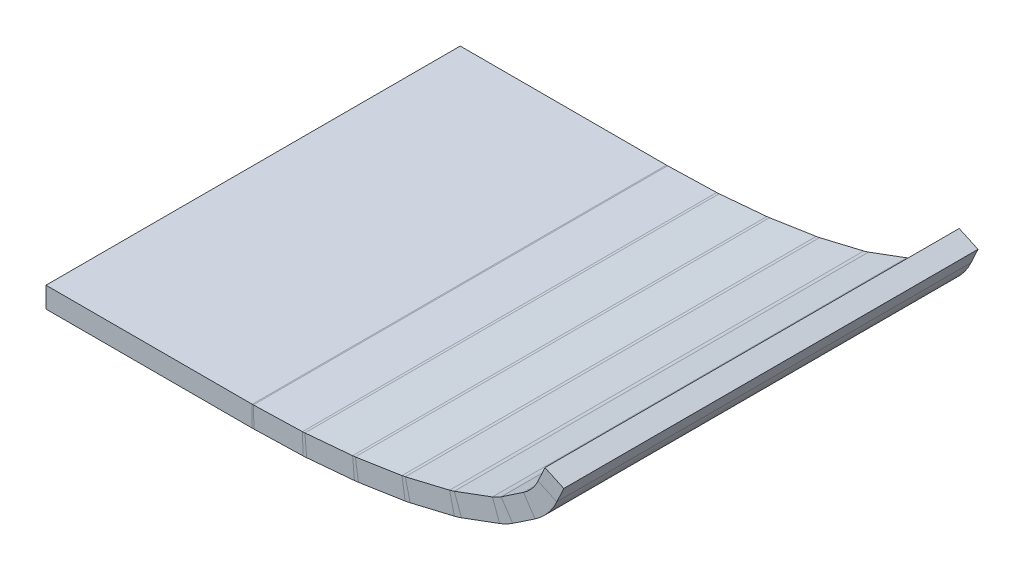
ISO-10303-21;
HEADER;
FILE_DESCRIPTION(('STEP AP214'),'2;1');
FILE_NAME('part.step','',(''),(''),'','','');
FILE_SCHEMA(('AUTOMOTIVE_DESIGN { 1 0 10303 214 1 1 1 1 }'));
ENDSEC;
DATA;
#1=APPLICATION_CONTEXT('core data for automotive mechanical design processes');
#2=APPLICATION_PROTOCOL_DEFINITION('international standard','automotive_design',2000,#1);
#3=PRODUCT_CONTEXT('',#1,'mechanical');
#4=PRODUCT('Part','Part','',(#3));
#5=PRODUCT_RELATED_PRODUCT_CATEGORY('part','',(#4));
#6=PRODUCT_DEFINITION_FORMATION('','',#4);
#7=PRODUCT_DEFINITION_CONTEXT('part definition',#1,'design');
#8=PRODUCT_DEFINITION('design','',#6,#7);
#9=PRODUCT_DEFINITION_SHAPE('','',#8);
#10=(LENGTH_UNIT() NAMED_UNIT(*) SI_UNIT(.MILLI.,.METRE.));
#11=(NAMED_UNIT(*) PLANE_ANGLE_UNIT() SI_UNIT($,.RADIAN.));
#12=(NAMED_UNIT(*) SI_UNIT($,.STERADIAN.) SOLID_ANGLE_UNIT());
#13=UNCERTAINTY_MEASURE_WITH_UNIT(LENGTH_MEASURE(1.E-05),#10,'distance_accuracy_value','');
#14=(GEOMETRIC_REPRESENTATION_CONTEXT(3) GLOBAL_UNCERTAINTY_ASSIGNED_CONTEXT((#13)) GLOBAL_UNIT_ASSIGNED_CONTEXT((#10,
#11,#12)) REPRESENTATION_CONTEXT('',''));
#15=CARTESIAN_POINT('',(0.,0.,0.));
#16=DIRECTION('',(0.,0.,1.));
#17=DIRECTION('',(1.,0.,0.));
#18=AXIS2_PLACEMENT_3D('',#15,#16,#17);
#19=CARTESIAN_POINT('',(-24.5708438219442,44.2603152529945,40.));
#20=DIRECTION('',(-0.417480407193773,-0.908685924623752,0.));
#21=DIRECTION('',(0.908685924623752,-0.417480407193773,0.));
#22=AXIS2_PLACEMENT_3D('',#19,#20,#21);
#23=PLANE('',#22);
#24=DIRECTION('',(0.908685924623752,-0.417480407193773,0.));
#25=VECTOR('',#24,1.);
#26=CARTESIAN_POINT('',(-24.5708438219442,44.2603152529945,40.));
#27=LINE('',#26,#25);
#28=CARTESIAN_POINT('',(48.1826281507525,10.8349608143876,40.));
#29=VERTEX_POINT('',#28);
#30=CARTESIAN_POINT('',(50.,10.0000000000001,40.));
#31=VERTEX_POINT('',#30);
#32=EDGE_CURVE('E279',#29,#31,#27,.T.);
#33=ORIENTED_EDGE('',*,*,#32,.T.);
#34=DIRECTION('',(0.,0.,-1.));
#35=VECTOR('',#34,1.);
#36=CARTESIAN_POINT('',(50.,10.,40.));
#37=LINE('',#36,#35);
#38=CARTESIAN_POINT('',(50.,10.,0.));
#39=VERTEX_POINT('',#38);
#40=EDGE_CURVE('E270',#31,#39,#37,.T.);
#41=ORIENTED_EDGE('',*,*,#40,.T.);
#42=DIRECTION('',(0.908685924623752,-0.417480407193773,0.));
#43=VECTOR('',#42,1.);
#44=CARTESIAN_POINT('',(-24.5708438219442,44.2603152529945,0.));
#45=LINE('',#44,#43);
#46=CARTESIAN_POINT('',(48.1826281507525,10.8349608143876,0.));
#47=VERTEX_POINT('',#46);
#48=EDGE_CURVE('E326',#47,#39,#45,.T.);
#49=ORIENTED_EDGE('',*,*,#48,.F.);
#50=DIRECTION('',(0.,0.,-1.));
#51=VECTOR('',#50,1.);
#52=CARTESIAN_POINT('',(48.1826281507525,10.8349608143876,40.));
#53=LINE('',#52,#51);
#54=EDGE_CURVE('E11',#29,#47,#53,.T.);
#55=ORIENTED_EDGE('',*,*,#54,.F.);
#56=EDGE_LOOP('',(#33,#41,#49,#55));
#57=FACE_BOUND('',#56,.T.);
#58=ADVANCED_FACE('F31',(#57),#23,.F.);
#59=CARTESIAN_POINT('',(-25.9457888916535,41.2676161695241,40.));
#60=DIRECTION('',(0.,0.,-1.));
#61=DIRECTION('',(-0.417480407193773,-0.908685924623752,0.));
#62=AXIS2_PLACEMENT_3D('',#59,#60,#61);
#63=PLANE('',#62);
#64=DIRECTION('',(0.908685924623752,-0.417480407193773,0.));
#65=VECTOR('',#64,1.);
#66=CARTESIAN_POINT('',(-25.2414817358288,42.8006078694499,40.));
#67=LINE('',#66,#65);
#68=CARTESIAN_POINT('',(47.5119902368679,9.37525343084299,40.));
#69=VERTEX_POINT('',#68);
#70=CARTESIAN_POINT('',(49.3293620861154,8.54029261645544,40.));
#71=VERTEX_POINT('',#70);
#72=EDGE_CURVE('E262',#69,#71,#67,.T.);
#73=ORIENTED_EDGE('',*,*,#72,.T.);
#74=DIRECTION('',(0.417480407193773,0.908685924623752,0.));
#75=VECTOR('',#74,1.);
#76=CARTESIAN_POINT('',(48.6250549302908,7.00730091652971,40.));
#77=LINE('',#76,#75);
#78=EDGE_CURVE('E71',#71,#31,#77,.T.);
#79=ORIENTED_EDGE('',*,*,#78,.T.);
#80=ORIENTED_EDGE('',*,*,#32,.F.);
#81=DIRECTION('',(0.417480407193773,0.908685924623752,0.));
#82=VECTOR('',#81,1.);
#83=CARTESIAN_POINT('',(46.8076830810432,7.84226173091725,40.));
#84=LINE('',#83,#82);
#85=EDGE_CURVE('E41',#69,#29,#84,.T.);
#86=ORIENTED_EDGE('',*,*,#85,.F.);
#87=EDGE_LOOP('',(#73,#79,#80,#86));
#88=FACE_BOUND('',#87,.T.);
#89=ADVANCED_FACE('F269',(#88),#63,.F.);
#90=CARTESIAN_POINT('',(48.6250549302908,7.00730091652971,40.));
#91=DIRECTION('',(-0.908685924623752,0.417480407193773,0.));
#92=DIRECTION('',(-0.417480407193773,-0.908685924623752,0.));
#93=AXIS2_PLACEMENT_3D('',#90,#91,#92);
#94=PLANE('',#93);
#95=ORIENTED_EDGE('',*,*,#78,.F.);
#96=DIRECTION('',(0.,0.,-1.));
#97=VECTOR('',#96,1.);
#98=CARTESIAN_POINT('',(49.3293620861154,8.54029261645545,40.));
#99=LINE('',#98,#97);
#100=CARTESIAN_POINT('',(49.3293620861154,8.54029261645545,0.));
#101=VERTEX_POINT('',#100);
#102=EDGE_CURVE('E250',#71,#101,#99,.T.);
#103=ORIENTED_EDGE('',*,*,#102,.T.);
#104=DIRECTION('',(0.417480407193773,0.908685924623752,0.));
#105=VECTOR('',#104,1.);
#106=CARTESIAN_POINT('',(48.6250549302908,7.0073009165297,0.));
#107=LINE('',#106,#105);
#108=EDGE_CURVE('E258',#101,#39,#107,.T.);
#109=ORIENTED_EDGE('',*,*,#108,.T.);
#110=ORIENTED_EDGE('',*,*,#40,.F.);
#111=EDGE_LOOP('',(#95,#103,#109,#110));
#112=FACE_BOUND('',#111,.T.);
#113=ADVANCED_FACE('F273',(#112),#94,.F.);
#114=CARTESIAN_POINT('',(-25.9457888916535,41.2676161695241,0.));
#115=DIRECTION('',(0.,0.,-1.));
#116=DIRECTION('',(-0.417480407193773,-0.908685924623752,0.));
#117=AXIS2_PLACEMENT_3D('',#114,#115,#116);
#118=PLANE('',#117);
#119=ORIENTED_EDGE('',*,*,#108,.F.);
#120=DIRECTION('',(0.908685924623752,-0.417480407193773,0.));
#121=VECTOR('',#120,1.);
#122=CARTESIAN_POINT('',(-25.2414817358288,42.8006078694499,0.));
#123=LINE('',#122,#121);
#124=CARTESIAN_POINT('',(47.5119902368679,9.37525343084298,0.));
#125=VERTEX_POINT('',#124);
#126=EDGE_CURVE('E280',#125,#101,#123,.T.);
#127=ORIENTED_EDGE('',*,*,#126,.F.);
#128=DIRECTION('',(0.417480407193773,0.908685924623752,0.));
#129=VECTOR('',#128,1.);
#130=CARTESIAN_POINT('',(46.8076830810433,7.84226173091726,0.));
#131=LINE('',#130,#129);
#132=EDGE_CURVE('E328',#125,#47,#131,.T.);
#133=ORIENTED_EDGE('',*,*,#132,.T.);
#134=ORIENTED_EDGE('',*,*,#48,.T.);
#135=EDGE_LOOP('',(#119,#127,#133,#134));
#136=FACE_BOUND('',#135,.T.);
#137=ADVANCED_FACE('F330',(#136),#118,.T.);
#138=CARTESIAN_POINT('',(46.8076830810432,7.84226173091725,40.));
#139=DIRECTION('',(-0.908685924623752,0.417480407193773,0.));
#140=DIRECTION('',(-0.417480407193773,-0.908685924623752,0.));
#141=AXIS2_PLACEMENT_3D('',#138,#139,#140);
#142=PLANE('',#141);
#143=DIRECTION('',(0.,0.,-1.));
#144=VECTOR('',#143,1.);
#145=CARTESIAN_POINT('',(47.5119902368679,9.37525343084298,40.));
#146=LINE('',#145,#144);
#147=EDGE_CURVE('E35',#69,#125,#146,.T.);
#148=ORIENTED_EDGE('',*,*,#147,.F.);
#149=ORIENTED_EDGE('',*,*,#85,.T.);
#150=ORIENTED_EDGE('',*,*,#54,.T.);
#151=ORIENTED_EDGE('',*,*,#132,.F.);
#152=EDGE_LOOP('',(#148,#149,#150,#151));
#153=FACE_BOUND('',#152,.T.);
#154=ADVANCED_FACE('F33',(#153),#142,.T.);
#155=CARTESIAN_POINT('',(-1.3713616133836,72.4060508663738,40.));
#156=DIRECTION('',(0.,0.,-1.));
#157=DIRECTION('',(-0.829864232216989,-0.557965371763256,0.));
#158=AXIS2_PLACEMENT_3D('',#155,#156,#157);
#159=PLANE('',#158);
#160=DIRECTION('',(0.557965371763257,-0.829864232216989,0.));
#161=VECTOR('',#160,1.);
#162=CARTESIAN_POINT('',(-0.776699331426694,72.8058764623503,40.));
#163=LINE('',#162,#161);
#164=CARTESIAN_POINT('',(43.9544653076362,6.27702811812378,40.));
#165=VERTEX_POINT('',#164);
#166=CARTESIAN_POINT('',(45.0703960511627,4.6172996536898,40.));
#167=VERTEX_POINT('',#166);
#168=EDGE_CURVE('E314',#165,#167,#163,.T.);
#169=ORIENTED_EDGE('',*,*,#168,.T.);
#170=DIRECTION('',(0.829864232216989,0.557965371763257,0.));
#171=VECTOR('',#170,1.);
#172=CARTESIAN_POINT('',(44.4757337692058,4.21747405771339,40.));
#173=LINE('',#172,#171);
#174=CARTESIAN_POINT('',(47.2250387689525,6.06598966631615,40.));
#175=VERTEX_POINT('',#174);
#176=EDGE_CURVE('E312',#167,#175,#173,.T.);
#177=ORIENTED_EDGE('',*,*,#176,.T.);
#178=DIRECTION('',(0.557965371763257,-0.829864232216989,0.));
#179=VECTOR('',#178,1.);
#180=CARTESIAN_POINT('',(1.37794338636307,74.2545664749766,40.));
#181=LINE('',#180,#179);
#182=CARTESIAN_POINT('',(46.1091080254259,7.72571813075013,40.));
#183=VERTEX_POINT('',#182);
#184=EDGE_CURVE('E265',#183,#175,#181,.T.);
#185=ORIENTED_EDGE('',*,*,#184,.F.);
#186=DIRECTION('',(0.829864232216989,0.557965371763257,0.));
#187=VECTOR('',#186,1.);
#188=CARTESIAN_POINT('',(43.3598030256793,5.87720252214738,40.));
#189=LINE('',#188,#187);
#190=EDGE_CURVE('E289',#165,#183,#189,.T.);
#191=ORIENTED_EDGE('',*,*,#190,.F.);
#192=EDGE_LOOP('',(#169,#177,#185,#191));
#193=FACE_BOUND('',#192,.T.);
#194=ADVANCED_FACE('F348',(#193),#159,.F.);
#195=CARTESIAN_POINT('',(44.4757337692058,4.21747405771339,40.));
#196=DIRECTION('',(-0.557965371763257,0.829864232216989,0.));
#197=DIRECTION('',(-0.829864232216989,-0.557965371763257,0.));
#198=AXIS2_PLACEMENT_3D('',#195,#196,#197);
#199=PLANE('',#198);
#200=DIRECTION('',(0.,0.,-1.));
#201=VECTOR('',#200,1.);
#202=CARTESIAN_POINT('',(47.2250387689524,6.06598966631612,40.));
#203=LINE('',#202,#201);
#204=CARTESIAN_POINT('',(47.2250387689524,6.06598966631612,0.));
#205=VERTEX_POINT('',#204);
#206=EDGE_CURVE('E318',#175,#205,#203,.T.);
#207=ORIENTED_EDGE('',*,*,#206,.F.);
#208=ORIENTED_EDGE('',*,*,#176,.F.);
#209=DIRECTION('',(0.,0.,-1.));
#210=VECTOR('',#209,1.);
#211=CARTESIAN_POINT('',(45.0703960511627,4.61729965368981,40.));
#212=LINE('',#211,#210);
#213=CARTESIAN_POINT('',(45.0703960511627,4.61729965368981,0.));
#214=VERTEX_POINT('',#213);
#215=EDGE_CURVE('E309',#167,#214,#212,.T.);
#216=ORIENTED_EDGE('',*,*,#215,.T.);
#217=DIRECTION('',(0.829864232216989,0.557965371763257,0.));
#218=VECTOR('',#217,1.);
#219=CARTESIAN_POINT('',(44.4757337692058,4.21747405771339,0.));
#220=LINE('',#219,#218);
#221=EDGE_CURVE('E306',#214,#205,#220,.T.);
#222=ORIENTED_EDGE('',*,*,#221,.T.);
#223=EDGE_LOOP('',(#207,#208,#216,#222));
#224=FACE_BOUND('',#223,.T.);
#225=ADVANCED_FACE('F352',(#224),#199,.F.);
#226=CARTESIAN_POINT('',(-1.3713616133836,72.4060508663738,0.));
#227=DIRECTION('',(0.,0.,-1.));
#228=DIRECTION('',(-0.829864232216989,-0.557965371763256,0.));
#229=AXIS2_PLACEMENT_3D('',#226,#227,#228);
#230=PLANE('',#229);
#231=ORIENTED_EDGE('',*,*,#221,.F.);
#232=DIRECTION('',(0.557965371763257,-0.829864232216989,0.));
#233=VECTOR('',#232,1.);
#234=CARTESIAN_POINT('',(-0.776699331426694,72.8058764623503,0.));
#235=LINE('',#234,#233);
#236=CARTESIAN_POINT('',(43.9544653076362,6.27702811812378,0.));
#237=VERTEX_POINT('',#236);
#238=EDGE_CURVE('E320',#237,#214,#235,.T.);
#239=ORIENTED_EDGE('',*,*,#238,.F.);
#240=DIRECTION('',(0.829864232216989,0.557965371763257,0.));
#241=VECTOR('',#240,1.);
#242=CARTESIAN_POINT('',(43.3598030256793,5.87720252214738,0.));
#243=LINE('',#242,#241);
#244=CARTESIAN_POINT('',(46.109108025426,7.72571813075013,0.));
#245=VERTEX_POINT('',#244);
#246=EDGE_CURVE('E304',#237,#245,#243,.T.);
#247=ORIENTED_EDGE('',*,*,#246,.T.);
#248=DIRECTION('',(0.557965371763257,-0.829864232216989,0.));
#249=VECTOR('',#248,1.);
#250=CARTESIAN_POINT('',(1.37794338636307,74.2545664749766,0.));
#251=LINE('',#250,#249);
#252=EDGE_CURVE('E296',#245,#205,#251,.T.);
#253=ORIENTED_EDGE('',*,*,#252,.T.);
#254=EDGE_LOOP('',(#231,#239,#247,#253));
#255=FACE_BOUND('',#254,.T.);
#256=ADVANCED_FACE('F358',(#255),#230,.T.);
#257=CARTESIAN_POINT('',(43.3598030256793,5.87720252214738,40.));
#258=DIRECTION('',(-0.557965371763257,0.829864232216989,0.));
#259=DIRECTION('',(-0.829864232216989,-0.557965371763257,0.));
#260=AXIS2_PLACEMENT_3D('',#257,#258,#259);
#261=PLANE('',#260);
#262=ORIENTED_EDGE('',*,*,#190,.T.);
#263=DIRECTION('',(0.,0.,-1.));
#264=VECTOR('',#263,1.);
#265=CARTESIAN_POINT('',(46.109108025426,7.7257181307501,40.));
#266=LINE('',#265,#264);
#267=EDGE_CURVE('E284',#183,#245,#266,.T.);
#268=ORIENTED_EDGE('',*,*,#267,.T.);
#269=ORIENTED_EDGE('',*,*,#246,.F.);
#270=DIRECTION('',(0.,0.,-1.));
#271=VECTOR('',#270,1.);
#272=CARTESIAN_POINT('',(43.9544653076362,6.27702811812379,40.));
#273=LINE('',#272,#271);
#274=EDGE_CURVE('E322',#165,#237,#273,.T.);
#275=ORIENTED_EDGE('',*,*,#274,.F.);
#276=EDGE_LOOP('',(#262,#268,#269,#275));
#277=FACE_BOUND('',#276,.T.);
#278=ADVANCED_FACE('F340',(#277),#261,.T.);
#279=CARTESIAN_POINT('',(11.2122653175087,79.7528920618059,40.));
#280=DIRECTION('',(0.,0.,-1.));
#281=DIRECTION('',(-0.937924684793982,-0.346838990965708,0.));
#282=AXIS2_PLACEMENT_3D('',#279,#280,#281);
#283=PLANE('',#282);
#284=DIRECTION('',(0.346838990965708,-0.937924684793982,0.));
#285=VECTOR('',#284,1.);
#286=CARTESIAN_POINT('',(11.5514025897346,79.8783030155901,40.));
#287=LINE('',#286,#285);
#288=CARTESIAN_POINT('',(39.4315696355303,4.48453942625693,40.));
#289=VERTEX_POINT('',#288);
#290=CARTESIAN_POINT('',(40.1252476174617,2.60869005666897,40.));
#291=VERTEX_POINT('',#290);
#292=EDGE_CURVE('E634',#289,#291,#287,.T.);
#293=ORIENTED_EDGE('',*,*,#292,.T.);
#294=DIRECTION('',(0.937924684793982,0.346838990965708,0.));
#295=VECTOR('',#294,1.);
#296=CARTESIAN_POINT('',(39.7861103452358,2.48327910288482,40.));
#297=LINE('',#296,#295);
#298=CARTESIAN_POINT('',(43.8036377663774,3.96893693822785,40.));
#299=VERTEX_POINT('',#298);
#300=EDGE_CURVE('E632',#291,#299,#297,.T.);
#301=ORIENTED_EDGE('',*,*,#300,.T.);
#302=DIRECTION('',(0.346838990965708,-0.937924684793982,0.));
#303=VECTOR('',#302,1.);
#304=CARTESIAN_POINT('',(15.2297927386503,81.238549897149,40.));
#305=LINE('',#304,#303);
#306=CARTESIAN_POINT('',(43.109959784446,5.84478630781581,40.));
#307=VERTEX_POINT('',#306);
#308=EDGE_CURVE('E383',#307,#299,#305,.T.);
#309=ORIENTED_EDGE('',*,*,#308,.F.);
#310=DIRECTION('',(0.937924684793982,0.346838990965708,0.));
#311=VECTOR('',#310,1.);
#312=CARTESIAN_POINT('',(39.0924323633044,4.35912847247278,40.));
#313=LINE('',#312,#311);
#314=EDGE_CURVE('E619',#289,#307,#313,.T.);
#315=ORIENTED_EDGE('',*,*,#314,.F.);
#316=EDGE_LOOP('',(#293,#301,#309,#315));
#317=FACE_BOUND('',#316,.T.);
#318=ADVANCED_FACE('F369',(#317),#283,.F.);
#319=CARTESIAN_POINT('',(39.7861103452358,2.48327910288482,40.));
#320=DIRECTION('',(-0.346838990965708,0.937924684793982,0.));
#321=DIRECTION('',(-0.937924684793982,-0.346838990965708,0.));
#322=AXIS2_PLACEMENT_3D('',#319,#320,#321);
#323=PLANE('',#322);
#324=DIRECTION('',(0.,0.,-1.));
#325=VECTOR('',#324,1.);
#326=CARTESIAN_POINT('',(43.8036377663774,3.96893693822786,40.));
#327=LINE('',#326,#325);
#328=CARTESIAN_POINT('',(43.8036377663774,3.96893693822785,0.));
#329=VERTEX_POINT('',#328);
#330=EDGE_CURVE('E638',#299,#329,#327,.T.);
#331=ORIENTED_EDGE('',*,*,#330,.F.);
#332=ORIENTED_EDGE('',*,*,#300,.F.);
#333=DIRECTION('',(0.,0.,-1.));
#334=VECTOR('',#333,1.);
#335=CARTESIAN_POINT('',(40.1252476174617,2.60869005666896,40.));
#336=LINE('',#335,#334);
#337=CARTESIAN_POINT('',(40.1252476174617,2.60869005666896,0.));
#338=VERTEX_POINT('',#337);
#339=EDGE_CURVE('E629',#291,#338,#336,.T.);
#340=ORIENTED_EDGE('',*,*,#339,.T.);
#341=DIRECTION('',(0.937924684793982,0.346838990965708,0.));
#342=VECTOR('',#341,1.);
#343=CARTESIAN_POINT('',(39.7861103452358,2.48327910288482,0.));
#344=LINE('',#343,#342);
#345=EDGE_CURVE('E626',#338,#329,#344,.T.);
#346=ORIENTED_EDGE('',*,*,#345,.T.);
#347=EDGE_LOOP('',(#331,#332,#340,#346));
#348=FACE_BOUND('',#347,.T.);
#349=ADVANCED_FACE('F659',(#348),#323,.F.);
#350=CARTESIAN_POINT('',(11.2122653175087,79.7528920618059,0.));
#351=DIRECTION('',(0.,0.,-1.));
#352=DIRECTION('',(-0.937924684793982,-0.346838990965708,0.));
#353=AXIS2_PLACEMENT_3D('',#350,#351,#352);
#354=PLANE('',#353);
#355=ORIENTED_EDGE('',*,*,#345,.F.);
#356=DIRECTION('',(0.346838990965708,-0.937924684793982,0.));
#357=VECTOR('',#356,1.);
#358=CARTESIAN_POINT('',(11.5514025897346,79.8783030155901,0.));
#359=LINE('',#358,#357);
#360=CARTESIAN_POINT('',(39.4315696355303,4.48453942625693,0.));
#361=VERTEX_POINT('',#360);
#362=EDGE_CURVE('E639',#361,#338,#359,.T.);
#363=ORIENTED_EDGE('',*,*,#362,.F.);
#364=DIRECTION('',(0.937924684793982,0.346838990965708,0.));
#365=VECTOR('',#364,1.);
#366=CARTESIAN_POINT('',(39.0924323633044,4.35912847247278,0.));
#367=LINE('',#366,#365);
#368=CARTESIAN_POINT('',(43.109959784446,5.84478630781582,0.));
#369=VERTEX_POINT('',#368);
#370=EDGE_CURVE('E623',#361,#369,#367,.T.);
#371=ORIENTED_EDGE('',*,*,#370,.T.);
#372=DIRECTION('',(0.346838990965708,-0.937924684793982,0.));
#373=VECTOR('',#372,1.);
#374=CARTESIAN_POINT('',(15.2297927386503,81.238549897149,0.));
#375=LINE('',#374,#373);
#376=EDGE_CURVE('E398',#369,#329,#375,.T.);
#377=ORIENTED_EDGE('',*,*,#376,.T.);
#378=EDGE_LOOP('',(#355,#363,#371,#377));
#379=FACE_BOUND('',#378,.T.);
#380=ADVANCED_FACE('F656',(#379),#354,.T.);
#381=CARTESIAN_POINT('',(39.0924323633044,4.35912847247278,40.));
#382=DIRECTION('',(-0.346838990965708,0.937924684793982,0.));
#383=DIRECTION('',(-0.937924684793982,-0.346838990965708,0.));
#384=AXIS2_PLACEMENT_3D('',#381,#382,#383);
#385=PLANE('',#384);
#386=ORIENTED_EDGE('',*,*,#314,.T.);
#387=DIRECTION('',(0.,0.,-1.));
#388=VECTOR('',#387,1.);
#389=CARTESIAN_POINT('',(43.109959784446,5.84478630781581,40.));
#390=LINE('',#389,#388);
#391=EDGE_CURVE('E323',#307,#369,#390,.T.);
#392=ORIENTED_EDGE('',*,*,#391,.T.);
#393=ORIENTED_EDGE('',*,*,#370,.F.);
#394=DIRECTION('',(0.,0.,-1.));
#395=VECTOR('',#394,1.);
#396=CARTESIAN_POINT('',(39.4315696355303,4.48453942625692,40.));
#397=LINE('',#396,#395);
#398=EDGE_CURVE('E299',#289,#361,#397,.T.);
#399=ORIENTED_EDGE('',*,*,#398,.F.);
#400=EDGE_LOOP('',(#386,#392,#393,#399));
#401=FACE_BOUND('',#400,.T.);
#402=ADVANCED_FACE('F362',(#401),#385,.T.);
#403=CARTESIAN_POINT('',(15.8120220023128,81.5611918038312,40.));
#404=DIRECTION('',(0.,0.,-1.));
#405=DIRECTION('',(-0.972789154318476,-0.231692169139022,0.));
#406=AXIS2_PLACEMENT_3D('',#403,#404,#405);
#407=PLANE('',#406);
#408=DIRECTION('',(0.231692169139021,-0.972789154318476,0.));
#409=VECTOR('',#408,1.);
#410=CARTESIAN_POINT('',(16.051967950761,81.6183404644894,40.));
#411=LINE('',#410,#409);
#412=CARTESIAN_POINT('',(34.6987261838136,3.32754522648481,40.));
#413=VERTEX_POINT('',#412);
#414=CARTESIAN_POINT('',(35.1621105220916,1.38196691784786,40.));
#415=VERTEX_POINT('',#414);
#416=EDGE_CURVE('E602',#413,#415,#411,.T.);
#417=ORIENTED_EDGE('',*,*,#416,.T.);
#418=DIRECTION('',(0.972789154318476,0.231692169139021,0.));
#419=VECTOR('',#418,1.);
#420=CARTESIAN_POINT('',(34.9221645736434,1.3248182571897,40.));
#421=LINE('',#420,#419);
#422=CARTESIAN_POINT('',(39.4343666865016,2.399503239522,40.));
#423=VERTEX_POINT('',#422);
#424=EDGE_CURVE('E588',#415,#423,#421,.T.);
#425=ORIENTED_EDGE('',*,*,#424,.T.);
#426=DIRECTION('',(0.231692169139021,-0.972789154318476,0.));
#427=VECTOR('',#426,1.);
#428=CARTESIAN_POINT('',(20.324224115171,82.6358767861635,40.));
#429=LINE('',#428,#427);
#430=CARTESIAN_POINT('',(38.9709823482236,4.34508154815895,40.));
#431=VERTEX_POINT('',#430);
#432=EDGE_CURVE('E611',#431,#423,#429,.T.);
#433=ORIENTED_EDGE('',*,*,#432,.F.);
#434=DIRECTION('',(0.972789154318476,0.231692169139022,0.));
#435=VECTOR('',#434,1.);
#436=CARTESIAN_POINT('',(34.4587802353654,3.27039656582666,40.));
#437=LINE('',#436,#435);
#438=EDGE_CURVE('E596',#413,#431,#437,.T.);
#439=ORIENTED_EDGE('',*,*,#438,.F.);
#440=EDGE_LOOP('',(#417,#425,#433,#439));
#441=FACE_BOUND('',#440,.T.);
#442=ADVANCED_FACE('F675',(#441),#407,.F.);
#443=CARTESIAN_POINT('',(15.8120220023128,81.5611918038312,0.));
#444=DIRECTION('',(0.,0.,-1.));
#445=DIRECTION('',(-0.972789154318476,-0.231692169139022,0.));
#446=AXIS2_PLACEMENT_3D('',#443,#444,#445);
#447=PLANE('',#446);
#448=DIRECTION('',(0.972789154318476,0.231692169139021,0.));
#449=VECTOR('',#448,1.);
#450=CARTESIAN_POINT('',(34.9221645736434,1.3248182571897,0.));
#451=LINE('',#450,#449);
#452=CARTESIAN_POINT('',(35.1621105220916,1.38196691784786,0.));
#453=VERTEX_POINT('',#452);
#454=CARTESIAN_POINT('',(39.4343666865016,2.39950323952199,0.));
#455=VERTEX_POINT('',#454);
#456=EDGE_CURVE('E427',#453,#455,#451,.T.);
#457=ORIENTED_EDGE('',*,*,#456,.F.);
#458=DIRECTION('',(0.231692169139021,-0.972789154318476,0.));
#459=VECTOR('',#458,1.);
#460=CARTESIAN_POINT('',(16.051967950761,81.6183404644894,0.));
#461=LINE('',#460,#459);
#462=CARTESIAN_POINT('',(34.6987261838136,3.32754522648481,0.));
#463=VERTEX_POINT('',#462);
#464=EDGE_CURVE('E605',#463,#453,#461,.T.);
#465=ORIENTED_EDGE('',*,*,#464,.F.);
#466=DIRECTION('',(0.972789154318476,0.231692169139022,0.));
#467=VECTOR('',#466,1.);
#468=CARTESIAN_POINT('',(34.4587802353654,3.27039656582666,0.));
#469=LINE('',#468,#467);
#470=CARTESIAN_POINT('',(38.9709823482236,4.34508154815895,0.));
#471=VERTEX_POINT('',#470);
#472=EDGE_CURVE('E593',#463,#471,#469,.T.);
#473=ORIENTED_EDGE('',*,*,#472,.T.);
#474=DIRECTION('',(0.231692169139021,-0.972789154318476,0.));
#475=VECTOR('',#474,1.);
#476=CARTESIAN_POINT('',(20.324224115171,82.6358767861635,0.));
#477=LINE('',#476,#475);
#478=EDGE_CURVE('E608',#471,#455,#477,.T.);
#479=ORIENTED_EDGE('',*,*,#478,.T.);
#480=EDGE_LOOP('',(#457,#465,#473,#479));
#481=FACE_BOUND('',#480,.T.);
#482=ADVANCED_FACE('F684',(#481),#447,.T.);
#483=CARTESIAN_POINT('',(34.4587802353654,3.27039656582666,40.));
#484=DIRECTION('',(-0.231692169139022,0.972789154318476,0.));
#485=DIRECTION('',(-0.972789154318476,-0.231692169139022,0.));
#486=AXIS2_PLACEMENT_3D('',#483,#484,#485);
#487=PLANE('',#486);
#488=ORIENTED_EDGE('',*,*,#438,.T.);
#489=DIRECTION('',(0.,0.,-1.));
#490=VECTOR('',#489,1.);
#491=CARTESIAN_POINT('',(38.9709823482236,4.34508154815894,40.));
#492=LINE('',#491,#490);
#493=EDGE_CURVE('E599',#431,#471,#492,.T.);
#494=ORIENTED_EDGE('',*,*,#493,.T.);
#495=ORIENTED_EDGE('',*,*,#472,.F.);
#496=DIRECTION('',(0.,0.,-1.));
#497=VECTOR('',#496,1.);
#498=CARTESIAN_POINT('',(34.6987261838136,3.32754522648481,40.));
#499=LINE('',#498,#497);
#500=EDGE_CURVE('E613',#413,#463,#499,.T.);
#501=ORIENTED_EDGE('',*,*,#500,.F.);
#502=EDGE_LOOP('',(#488,#494,#495,#501));
#503=FACE_BOUND('',#502,.T.);
#504=ADVANCED_FACE('F689',(#503),#487,.T.);
#505=CARTESIAN_POINT('',(34.9221645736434,1.3248182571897,40.));
#506=DIRECTION('',(-0.231692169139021,0.972789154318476,0.));
#507=DIRECTION('',(-0.972789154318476,-0.231692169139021,0.));
#508=AXIS2_PLACEMENT_3D('',#505,#506,#507);
#509=PLANE('',#508);
#510=DIRECTION('',(0.,0.,-1.));
#511=VECTOR('',#510,1.);
#512=CARTESIAN_POINT('',(39.4343666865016,2.39950323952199,40.));
#513=LINE('',#512,#511);
#514=EDGE_CURVE('E591',#423,#455,#513,.T.);
#515=ORIENTED_EDGE('',*,*,#514,.F.);
#516=ORIENTED_EDGE('',*,*,#424,.F.);
#517=DIRECTION('',(0.,0.,-1.));
#518=VECTOR('',#517,1.);
#519=CARTESIAN_POINT('',(35.1621105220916,1.38196691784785,40.));
#520=LINE('',#519,#518);
#521=EDGE_CURVE('E615',#415,#453,#520,.T.);
#522=ORIENTED_EDGE('',*,*,#521,.T.);
#523=ORIENTED_EDGE('',*,*,#456,.T.);
#524=EDGE_LOOP('',(#515,#516,#522,#523));
#525=FACE_BOUND('',#524,.T.);
#526=ADVANCED_FACE('F698',(#525),#509,.F.);
#527=CARTESIAN_POINT('',(0.,91.3678289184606,40.));
#528=DIRECTION('',(-1.,0.,0.));
#529=DIRECTION('',(0.,0.,1.));
#530=AXIS2_PLACEMENT_3D('',#527,#528,#529);
#531=PLANE('',#530);
#532=DIRECTION('',(0.,0.,-1.));
#533=VECTOR('',#532,1.);
#534=CARTESIAN_POINT('',(0.,0.,40.));
#535=LINE('',#534,#533);
#536=CARTESIAN_POINT('',(0.,0.,40.));
#537=VERTEX_POINT('',#536);
#538=CARTESIAN_POINT('',(0.,0.,0.));
#539=VERTEX_POINT('',#538);
#540=EDGE_CURVE('E569',#537,#539,#535,.T.);
#541=ORIENTED_EDGE('',*,*,#540,.F.);
#542=DIRECTION('',(0.,-1.,0.));
#543=VECTOR('',#542,1.);
#544=CARTESIAN_POINT('',(0.,91.3678289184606,40.));
#545=LINE('',#544,#543);
#546=CARTESIAN_POINT('',(0.,2.,40.));
#547=VERTEX_POINT('',#546);
#548=EDGE_CURVE('E575',#547,#537,#545,.T.);
#549=ORIENTED_EDGE('',*,*,#548,.F.);
#550=DIRECTION('',(0.,0.,-1.));
#551=VECTOR('',#550,1.);
#552=CARTESIAN_POINT('',(0.,2.,40.));
#553=LINE('',#552,#551);
#554=CARTESIAN_POINT('',(0.,2.,0.));
#555=VERTEX_POINT('',#554);
#556=EDGE_CURVE('E580',#547,#555,#553,.T.);
#557=ORIENTED_EDGE('',*,*,#556,.T.);
#558=DIRECTION('',(0.,-1.,0.));
#559=VECTOR('',#558,1.);
#560=CARTESIAN_POINT('',(0.,91.3678289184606,0.));
#561=LINE('',#560,#559);
#562=EDGE_CURVE('E578',#555,#539,#561,.T.);
#563=ORIENTED_EDGE('',*,*,#562,.T.);
#564=EDGE_LOOP('',(#541,#549,#557,#563));
#565=FACE_BOUND('',#564,.T.);
#566=ADVANCED_FACE('F809',(#565),#531,.T.);
#567=CARTESIAN_POINT('',(0.,91.3678289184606,40.));
#568=DIRECTION('',(0.,0.,-1.));
#569=DIRECTION('',(-1.,0.,0.));
#570=AXIS2_PLACEMENT_3D('',#567,#568,#569);
#571=PLANE('',#570);
#572=ORIENTED_EDGE('',*,*,#548,.T.);
#573=DIRECTION('',(1.,0.,0.));
#574=VECTOR('',#573,1.);
#575=CARTESIAN_POINT('',(0.,0.,40.));
#576=LINE('',#575,#574);
#577=CARTESIAN_POINT('',(19.9161294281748,0.,40.));
#578=VERTEX_POINT('',#577);
#579=EDGE_CURVE('E572',#537,#578,#576,.T.);
#580=ORIENTED_EDGE('',*,*,#579,.T.);
#581=DIRECTION('',(0.,-1.,0.));
#582=VECTOR('',#581,1.);
#583=CARTESIAN_POINT('',(19.9161294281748,91.3678289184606,40.));
#584=LINE('',#583,#582);
#585=CARTESIAN_POINT('',(19.9161294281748,2.,40.));
#586=VERTEX_POINT('',#585);
#587=EDGE_CURVE('E550',#586,#578,#584,.T.);
#588=ORIENTED_EDGE('',*,*,#587,.F.);
#589=DIRECTION('',(1.,0.,0.));
#590=VECTOR('',#589,1.);
#591=CARTESIAN_POINT('',(0.,2.,40.));
#592=LINE('',#591,#590);
#593=EDGE_CURVE('E557',#547,#586,#592,.T.);
#594=ORIENTED_EDGE('',*,*,#593,.F.);
#595=EDGE_LOOP('',(#572,#580,#588,#594));
#596=FACE_BOUND('',#595,.T.);
#597=ADVANCED_FACE('F812',(#596),#571,.F.);
#598=CARTESIAN_POINT('',(0.,0.,40.));
#599=DIRECTION('',(0.,1.,0.));
#600=DIRECTION('',(0.,0.,1.));
#601=AXIS2_PLACEMENT_3D('',#598,#599,#600);
#602=PLANE('',#601);
#603=DIRECTION('',(0.,0.,-1.));
#604=VECTOR('',#603,1.);
#605=CARTESIAN_POINT('',(19.9161294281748,0.,40.));
#606=LINE('',#605,#604);
#607=CARTESIAN_POINT('',(19.9161294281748,0.,0.));
#608=VERTEX_POINT('',#607);
#609=EDGE_CURVE('E545',#578,#608,#606,.T.);
#610=ORIENTED_EDGE('',*,*,#609,.F.);
#611=ORIENTED_EDGE('',*,*,#579,.F.);
#612=ORIENTED_EDGE('',*,*,#540,.T.);
#613=DIRECTION('',(1.,0.,0.));
#614=VECTOR('',#613,1.);
#615=CARTESIAN_POINT('',(0.,0.,0.));
#616=LINE('',#615,#614);
#617=EDGE_CURVE('E566',#539,#608,#616,.T.);
#618=ORIENTED_EDGE('',*,*,#617,.T.);
#619=EDGE_LOOP('',(#610,#611,#612,#618));
#620=FACE_BOUND('',#619,.T.);
#621=ADVANCED_FACE('F805',(#620),#602,.F.);
#622=CARTESIAN_POINT('',(0.,91.3678289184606,0.));
#623=DIRECTION('',(0.,0.,-1.));
#624=DIRECTION('',(-1.,0.,0.));
#625=AXIS2_PLACEMENT_3D('',#622,#623,#624);
#626=PLANE('',#625);
#627=ORIENTED_EDGE('',*,*,#617,.F.);
#628=ORIENTED_EDGE('',*,*,#562,.F.);
#629=DIRECTION('',(1.,0.,0.));
#630=VECTOR('',#629,1.);
#631=CARTESIAN_POINT('',(0.,2.,0.));
#632=LINE('',#631,#630);
#633=CARTESIAN_POINT('',(19.9161294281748,2.,0.));
#634=VERTEX_POINT('',#633);
#635=EDGE_CURVE('E563',#555,#634,#632,.T.);
#636=ORIENTED_EDGE('',*,*,#635,.T.);
#637=DIRECTION('',(0.,-1.,0.));
#638=VECTOR('',#637,1.);
#639=CARTESIAN_POINT('',(19.9161294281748,91.3678289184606,0.));
#640=LINE('',#639,#638);
#641=EDGE_CURVE('E560',#634,#608,#640,.T.);
#642=ORIENTED_EDGE('',*,*,#641,.T.);
#643=EDGE_LOOP('',(#627,#628,#636,#642));
#644=FACE_BOUND('',#643,.T.);
#645=ADVANCED_FACE('F801',(#644),#626,.T.);
#646=CARTESIAN_POINT('',(0.,2.,40.));
#647=DIRECTION('',(0.,1.,0.));
#648=DIRECTION('',(0.,0.,1.));
#649=AXIS2_PLACEMENT_3D('',#646,#647,#648);
#650=PLANE('',#649);
#651=ORIENTED_EDGE('',*,*,#593,.T.);
#652=DIRECTION('',(0.,0.,-1.));
#653=VECTOR('',#652,1.);
#654=CARTESIAN_POINT('',(19.9161294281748,2.,40.));
#655=LINE('',#654,#653);
#656=EDGE_CURVE('E554',#586,#634,#655,.T.);
#657=ORIENTED_EDGE('',*,*,#656,.T.);
#658=ORIENTED_EDGE('',*,*,#635,.F.);
#659=ORIENTED_EDGE('',*,*,#556,.F.);
#660=EDGE_LOOP('',(#651,#657,#658,#659));
#661=FACE_BOUND('',#660,.T.);
#662=ADVANCED_FACE('F814',(#661),#650,.T.);
#663=CARTESIAN_POINT('',(19.9161294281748,6.,40.));
#664=DIRECTION('',(0.,0.,1.));
#665=DIRECTION('',(1.,0.,0.));
#666=AXIS2_PLACEMENT_3D('',#663,#664,#665);
#667=PLANE('',#666);
#668=DIRECTION('',(0.0279513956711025,-0.999609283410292,0.));
#669=VECTOR('',#668,1.);
#670=CARTESIAN_POINT('',(17.7761663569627,82.5302376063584,40.));
#671=LINE('',#670,#669);
#672=CARTESIAN_POINT('',(20.0279350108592,2.00156286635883,40.));
#673=VERTEX_POINT('',#672);
#674=CARTESIAN_POINT('',(20.0838378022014,0.00234429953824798,40.));
#675=VERTEX_POINT('',#674);
#676=EDGE_CURVE('E532',#673,#675,#671,.T.);
#677=ORIENTED_EDGE('',*,*,#676,.F.);
#678=CARTESIAN_POINT('',(19.9161294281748,6.,40.));
#679=DIRECTION('',(0.,0.,-1.));
#680=DIRECTION('',(-1.,0.,0.));
#681=AXIS2_PLACEMENT_3D('',#678,#679,#680);
#682=CIRCLE('',#681,4.);
#683=EDGE_CURVE('E552',#673,#586,#682,.T.);
#684=ORIENTED_EDGE('',*,*,#683,.T.);
#685=ORIENTED_EDGE('',*,*,#587,.T.);
#686=CARTESIAN_POINT('',(19.9161294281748,6.,40.));
#687=DIRECTION('',(0.,0.,-1.));
#688=DIRECTION('',(-1.,0.,0.));
#689=AXIS2_PLACEMENT_3D('',#686,#687,#688);
#690=CIRCLE('',#689,6.);
#691=EDGE_CURVE('E547',#675,#578,#690,.T.);
#692=ORIENTED_EDGE('',*,*,#691,.F.);
#693=EDGE_LOOP('',(#677,#684,#685,#692));
#694=FACE_BOUND('',#693,.T.);
#695=ADVANCED_FACE('F784',(#694),#667,.T.);
#696=CARTESIAN_POINT('',(19.9161294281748,6.,105.683083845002));
#697=DIRECTION('',(0.,0.,-1.));
#698=DIRECTION('',(-1.,0.,0.));
#699=AXIS2_PLACEMENT_3D('',#696,#697,#698);
#700=CYLINDRICAL_SURFACE('',#699,6.);
#701=ORIENTED_EDGE('',*,*,#691,.T.);
#702=ORIENTED_EDGE('',*,*,#609,.T.);
#703=CARTESIAN_POINT('',(19.9161294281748,6.,0.));
#704=DIRECTION('',(0.,0.,-1.));
#705=DIRECTION('',(-1.,0.,0.));
#706=AXIS2_PLACEMENT_3D('',#703,#704,#705);
#707=CIRCLE('',#706,6.);
#708=CARTESIAN_POINT('',(20.0838378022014,0.00234429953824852,0.));
#709=VERTEX_POINT('',#708);
#710=EDGE_CURVE('E543',#608,#709,#707,.F.);
#711=ORIENTED_EDGE('',*,*,#710,.T.);
#712=DIRECTION('',(0.,0.,-1.));
#713=VECTOR('',#712,1.);
#714=CARTESIAN_POINT('',(20.0838378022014,0.00234429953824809,40.));
#715=LINE('',#714,#713);
#716=EDGE_CURVE('E526',#675,#709,#715,.T.);
#717=ORIENTED_EDGE('',*,*,#716,.F.);
#718=EDGE_LOOP('',(#701,#702,#711,#717));
#719=FACE_BOUND('',#718,.T.);
#720=ADVANCED_FACE('F781',(#719),#700,.T.);
#721=CARTESIAN_POINT('',(19.9161294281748,6.,0.));
#722=DIRECTION('',(0.,0.,-1.));
#723=DIRECTION('',(-1.,0.,0.));
#724=AXIS2_PLACEMENT_3D('',#721,#722,#723);
#725=PLANE('',#724);
#726=ORIENTED_EDGE('',*,*,#641,.F.);
#727=CARTESIAN_POINT('',(19.9161294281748,6.,0.));
#728=DIRECTION('',(0.,0.,-1.));
#729=DIRECTION('',(-1.,0.,0.));
#730=AXIS2_PLACEMENT_3D('',#727,#728,#729);
#731=CIRCLE('',#730,4.);
#732=CARTESIAN_POINT('',(20.0279350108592,2.00156286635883,0.));
#733=VERTEX_POINT('',#732);
#734=EDGE_CURVE('E540',#634,#733,#731,.F.);
#735=ORIENTED_EDGE('',*,*,#734,.T.);
#736=DIRECTION('',(0.0279513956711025,-0.999609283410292,0.));
#737=VECTOR('',#736,1.);
#738=CARTESIAN_POINT('',(17.7761663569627,82.5302376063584,0.));
#739=LINE('',#738,#737);
#740=EDGE_CURVE('E537',#733,#709,#739,.T.);
#741=ORIENTED_EDGE('',*,*,#740,.T.);
#742=ORIENTED_EDGE('',*,*,#710,.F.);
#743=EDGE_LOOP('',(#726,#735,#741,#742));
#744=FACE_BOUND('',#743,.T.);
#745=ADVANCED_FACE('F798',(#744),#725,.T.);
#746=CARTESIAN_POINT('',(19.9161294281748,6.,105.683083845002));
#747=DIRECTION('',(0.,0.,-1.));
#748=DIRECTION('',(-1.,0.,0.));
#749=AXIS2_PLACEMENT_3D('',#746,#747,#748);
#750=CYLINDRICAL_SURFACE('',#749,4.);
#751=ORIENTED_EDGE('',*,*,#683,.F.);
#752=DIRECTION('',(0.,0.,-1.));
#753=VECTOR('',#752,1.);
#754=CARTESIAN_POINT('',(20.0279350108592,2.00156286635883,40.));
#755=LINE('',#754,#753);
#756=EDGE_CURVE('E535',#673,#733,#755,.T.);
#757=ORIENTED_EDGE('',*,*,#756,.T.);
#758=ORIENTED_EDGE('',*,*,#734,.F.);
#759=ORIENTED_EDGE('',*,*,#656,.F.);
#760=EDGE_LOOP('',(#751,#757,#758,#759));
#761=FACE_BOUND('',#760,.T.);
#762=ADVANCED_FACE('F795',(#761),#750,.F.);
#763=CARTESIAN_POINT('',(17.6923285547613,82.5278933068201,40.));
#764=DIRECTION('',(0.,0.,-1.));
#765=DIRECTION('',(-0.999609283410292,-0.0279513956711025,0.));
#766=AXIS2_PLACEMENT_3D('',#763,#764,#765);
#767=PLANE('',#766);
#768=ORIENTED_EDGE('',*,*,#676,.T.);
#769=DIRECTION('',(0.999609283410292,0.0279513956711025,0.));
#770=VECTOR('',#769,1.);
#771=CARTESIAN_POINT('',(20.,0.,40.));
#772=LINE('',#771,#770);
#773=CARTESIAN_POINT('',(24.8237652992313,0.134883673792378,40.));
#774=VERTEX_POINT('',#773);
#775=EDGE_CURVE('E529',#675,#774,#772,.T.);
#776=ORIENTED_EDGE('',*,*,#775,.T.);
#777=DIRECTION('',(0.0279513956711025,-0.999609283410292,0.));
#778=VECTOR('',#777,1.);
#779=CARTESIAN_POINT('',(22.5160938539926,82.6627769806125,40.));
#780=LINE('',#779,#778);
#781=CARTESIAN_POINT('',(24.7678625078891,2.13410224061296,40.));
#782=VERTEX_POINT('',#781);
#783=EDGE_CURVE('E507',#782,#774,#780,.T.);
#784=ORIENTED_EDGE('',*,*,#783,.F.);
#785=DIRECTION('',(0.999609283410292,0.0279513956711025,0.));
#786=VECTOR('',#785,1.);
#787=CARTESIAN_POINT('',(19.9440972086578,1.99921856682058,40.));
#788=LINE('',#787,#786);
#789=EDGE_CURVE('E514',#673,#782,#788,.T.);
#790=ORIENTED_EDGE('',*,*,#789,.F.);
#791=EDGE_LOOP('',(#768,#776,#784,#790));
#792=FACE_BOUND('',#791,.T.);
#793=ADVANCED_FACE('F789',(#792),#767,.F.);
#794=CARTESIAN_POINT('',(20.,0.,40.));
#795=DIRECTION('',(-0.0279513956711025,0.999609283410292,0.));
#796=DIRECTION('',(-0.999609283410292,-0.0279513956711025,0.));
#797=AXIS2_PLACEMENT_3D('',#794,#795,#796);
#798=PLANE('',#797);
#799=DIRECTION('',(0.,0.,-1.));
#800=VECTOR('',#799,1.);
#801=CARTESIAN_POINT('',(24.8237652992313,0.134883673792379,40.));
#802=LINE('',#801,#800);
#803=CARTESIAN_POINT('',(24.8237652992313,0.13488367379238,0.));
#804=VERTEX_POINT('',#803);
#805=EDGE_CURVE('E502',#774,#804,#802,.T.);
#806=ORIENTED_EDGE('',*,*,#805,.F.);
#807=ORIENTED_EDGE('',*,*,#775,.F.);
#808=ORIENTED_EDGE('',*,*,#716,.T.);
#809=DIRECTION('',(0.999609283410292,0.0279513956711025,0.));
#810=VECTOR('',#809,1.);
#811=CARTESIAN_POINT('',(20.,0.,0.));
#812=LINE('',#811,#810);
#813=EDGE_CURVE('E523',#709,#804,#812,.T.);
#814=ORIENTED_EDGE('',*,*,#813,.T.);
#815=EDGE_LOOP('',(#806,#807,#808,#814));
#816=FACE_BOUND('',#815,.T.);
#817=ADVANCED_FACE('F777',(#816),#798,.F.);
#818=CARTESIAN_POINT('',(17.6923285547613,82.5278933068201,0.));
#819=DIRECTION('',(0.,0.,-1.));
#820=DIRECTION('',(-0.999609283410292,-0.0279513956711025,0.));
#821=AXIS2_PLACEMENT_3D('',#818,#819,#820);
#822=PLANE('',#821);
#823=ORIENTED_EDGE('',*,*,#813,.F.);
#824=ORIENTED_EDGE('',*,*,#740,.F.);
#825=DIRECTION('',(0.999609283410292,0.0279513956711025,0.));
#826=VECTOR('',#825,1.);
#827=CARTESIAN_POINT('',(19.9440972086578,1.99921856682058,0.));
#828=LINE('',#827,#826);
#829=CARTESIAN_POINT('',(24.7678625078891,2.13410224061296,0.));
#830=VERTEX_POINT('',#829);
#831=EDGE_CURVE('E520',#733,#830,#828,.T.);
#832=ORIENTED_EDGE('',*,*,#831,.T.);
#833=DIRECTION('',(0.0279513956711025,-0.999609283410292,0.));
#834=VECTOR('',#833,1.);
#835=CARTESIAN_POINT('',(22.5160938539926,82.6627769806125,0.));
#836=LINE('',#835,#834);
#837=EDGE_CURVE('E517',#830,#804,#836,.T.);
#838=ORIENTED_EDGE('',*,*,#837,.T.);
#839=EDGE_LOOP('',(#823,#824,#832,#838));
#840=FACE_BOUND('',#839,.T.);
#841=ADVANCED_FACE('F772',(#840),#822,.T.);
#842=CARTESIAN_POINT('',(19.9440972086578,1.99921856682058,40.));
#843=DIRECTION('',(-0.0279513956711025,0.999609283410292,0.));
#844=DIRECTION('',(-0.999609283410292,-0.0279513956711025,0.));
#845=AXIS2_PLACEMENT_3D('',#842,#843,#844);
#846=PLANE('',#845);
#847=ORIENTED_EDGE('',*,*,#789,.T.);
#848=DIRECTION('',(0.,0.,-1.));
#849=VECTOR('',#848,1.);
#850=CARTESIAN_POINT('',(24.7678625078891,2.13410224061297,40.));
#851=LINE('',#850,#849);
#852=EDGE_CURVE('E511',#782,#830,#851,.T.);
#853=ORIENTED_EDGE('',*,*,#852,.T.);
#854=ORIENTED_EDGE('',*,*,#831,.F.);
#855=ORIENTED_EDGE('',*,*,#756,.F.);
#856=EDGE_LOOP('',(#847,#853,#854,#855));
#857=FACE_BOUND('',#856,.T.);
#858=ADVANCED_FACE('F792',(#857),#846,.T.);
#859=CARTESIAN_POINT('',(24.6560569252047,6.13253937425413,40.));
#860=DIRECTION('',(0.,0.,1.));
#861=DIRECTION('',(1.,0.,0.));
#862=AXIS2_PLACEMENT_3D('',#859,#860,#861);
#863=PLANE('',#862);
#864=DIRECTION('',(0.0859489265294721,-0.996299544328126,0.));
#865=VECTOR('',#864,1.);
#866=CARTESIAN_POINT('',(18.0780532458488,82.3831958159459,40.));
#867=LINE('',#866,#865);
#868=CARTESIAN_POINT('',(24.9998526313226,2.14734119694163,40.));
#869=VERTEX_POINT('',#868);
#870=CARTESIAN_POINT('',(25.1717504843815,0.154742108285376,40.));
#871=VERTEX_POINT('',#870);
#872=EDGE_CURVE('E489',#869,#871,#867,.T.);
#873=ORIENTED_EDGE('',*,*,#872,.F.);
#874=CARTESIAN_POINT('',(24.6560569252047,6.13253937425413,40.));
#875=DIRECTION('',(0.,0.,-1.));
#876=DIRECTION('',(-1.,0.,0.));
#877=AXIS2_PLACEMENT_3D('',#874,#875,#876);
#878=CIRCLE('',#877,4.);
#879=EDGE_CURVE('E509',#869,#782,#878,.T.);
#880=ORIENTED_EDGE('',*,*,#879,.T.);
#881=ORIENTED_EDGE('',*,*,#783,.T.);
#882=CARTESIAN_POINT('',(24.6560569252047,6.13253937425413,40.));
#883=DIRECTION('',(0.,0.,-1.));
#884=DIRECTION('',(-1.,0.,0.));
#885=AXIS2_PLACEMENT_3D('',#882,#883,#884);
#886=CIRCLE('',#885,6.);
#887=EDGE_CURVE('E504',#871,#774,#886,.T.);
#888=ORIENTED_EDGE('',*,*,#887,.F.);
#889=EDGE_LOOP('',(#873,#880,#881,#888));
#890=FACE_BOUND('',#889,.T.);
#891=ADVANCED_FACE('F755',(#890),#863,.T.);
#892=CARTESIAN_POINT('',(24.6560569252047,6.13253937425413,105.728697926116));
#893=DIRECTION('',(0.,0.,-1.));
#894=DIRECTION('',(-1.,0.,0.));
#895=AXIS2_PLACEMENT_3D('',#892,#893,#894);
#896=CYLINDRICAL_SURFACE('',#895,6.);
#897=ORIENTED_EDGE('',*,*,#887,.T.);
#898=ORIENTED_EDGE('',*,*,#805,.T.);
#899=CARTESIAN_POINT('',(24.6560569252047,6.13253937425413,0.));
#900=DIRECTION('',(0.,0.,-1.));
#901=DIRECTION('',(-1.,0.,0.));
#902=AXIS2_PLACEMENT_3D('',#899,#900,#901);
#903=CIRCLE('',#902,6.);
#904=CARTESIAN_POINT('',(25.1717504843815,0.154742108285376,0.));
#905=VERTEX_POINT('',#904);
#906=EDGE_CURVE('E500',#804,#905,#903,.F.);
#907=ORIENTED_EDGE('',*,*,#906,.T.);
#908=DIRECTION('',(0.,0.,-1.));
#909=VECTOR('',#908,1.);
#910=CARTESIAN_POINT('',(25.1717504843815,0.154742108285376,40.));
#911=LINE('',#910,#909);
#912=EDGE_CURVE('E483',#871,#905,#911,.T.);
#913=ORIENTED_EDGE('',*,*,#912,.F.);
#914=EDGE_LOOP('',(#897,#898,#907,#913));
#915=FACE_BOUND('',#914,.T.);
#916=ADVANCED_FACE('F752',(#915),#896,.T.);
#917=CARTESIAN_POINT('',(24.6560569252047,6.13253937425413,0.));
#918=DIRECTION('',(0.,0.,-1.));
#919=DIRECTION('',(-1.,0.,0.));
#920=AXIS2_PLACEMENT_3D('',#917,#918,#919);
#921=PLANE('',#920);
#922=ORIENTED_EDGE('',*,*,#837,.F.);
#923=CARTESIAN_POINT('',(24.6560569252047,6.13253937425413,0.));
#924=DIRECTION('',(0.,0.,-1.));
#925=DIRECTION('',(-1.,0.,0.));
#926=AXIS2_PLACEMENT_3D('',#923,#924,#925);
#927=CIRCLE('',#926,4.);
#928=CARTESIAN_POINT('',(24.9998526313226,2.14734119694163,0.));
#929=VERTEX_POINT('',#928);
#930=EDGE_CURVE('E497',#830,#929,#927,.F.);
#931=ORIENTED_EDGE('',*,*,#930,.T.);
#932=DIRECTION('',(0.0859489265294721,-0.996299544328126,0.));
#933=VECTOR('',#932,1.);
#934=CARTESIAN_POINT('',(18.0780532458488,82.3831958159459,0.));
#935=LINE('',#934,#933);
#936=EDGE_CURVE('E494',#929,#905,#935,.T.);
#937=ORIENTED_EDGE('',*,*,#936,.T.);
#938=ORIENTED_EDGE('',*,*,#906,.F.);
#939=EDGE_LOOP('',(#922,#931,#937,#938));
#940=FACE_BOUND('',#939,.T.);
#941=ADVANCED_FACE('F769',(#940),#921,.T.);
#942=CARTESIAN_POINT('',(24.6560569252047,6.13253937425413,105.728697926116));
#943=DIRECTION('',(0.,0.,-1.));
#944=DIRECTION('',(-1.,0.,0.));
#945=AXIS2_PLACEMENT_3D('',#942,#943,#944);
#946=CYLINDRICAL_SURFACE('',#945,4.);
#947=ORIENTED_EDGE('',*,*,#879,.F.);
#948=DIRECTION('',(0.,0.,-1.));
#949=VECTOR('',#948,1.);
#950=CARTESIAN_POINT('',(24.9998526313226,2.14734119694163,40.));
#951=LINE('',#950,#949);
#952=EDGE_CURVE('E492',#869,#929,#951,.T.);
#953=ORIENTED_EDGE('',*,*,#952,.T.);
#954=ORIENTED_EDGE('',*,*,#930,.F.);
#955=ORIENTED_EDGE('',*,*,#852,.F.);
#956=EDGE_LOOP('',(#947,#953,#954,#955));
#957=FACE_BOUND('',#956,.T.);
#958=ADVANCED_FACE('F766',(#957),#946,.F.);
#959=CARTESIAN_POINT('',(17.9043491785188,82.3682106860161,40.));
#960=DIRECTION('',(0.,0.,-1.));
#961=DIRECTION('',(-0.996299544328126,-0.0859489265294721,0.));
#962=AXIS2_PLACEMENT_3D('',#959,#960,#961);
#963=PLANE('',#962);
#964=ORIENTED_EDGE('',*,*,#872,.T.);
#965=DIRECTION('',(0.996299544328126,0.0859489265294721,0.));
#966=VECTOR('',#965,1.);
#967=CARTESIAN_POINT('',(24.9980464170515,0.139756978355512,40.));
#968=LINE('',#967,#966);
#969=CARTESIAN_POINT('',(29.7834356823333,0.552583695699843,40.));
#970=VERTEX_POINT('',#969);
#971=EDGE_CURVE('E486',#871,#970,#968,.T.);
#972=ORIENTED_EDGE('',*,*,#971,.T.);
#973=DIRECTION('',(0.0859489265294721,-0.996299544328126,0.));
#974=VECTOR('',#973,1.);
#975=CARTESIAN_POINT('',(22.6897384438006,82.7810374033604,40.));
#976=LINE('',#975,#974);
#977=CARTESIAN_POINT('',(29.6115378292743,2.54518278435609,40.));
#978=VERTEX_POINT('',#977);
#979=EDGE_CURVE('E464',#978,#970,#976,.T.);
#980=ORIENTED_EDGE('',*,*,#979,.F.);
#981=DIRECTION('',(0.996299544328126,0.0859489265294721,0.));
#982=VECTOR('',#981,1.);
#983=CARTESIAN_POINT('',(24.8261485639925,2.13235606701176,40.));
#984=LINE('',#983,#982);
#985=EDGE_CURVE('E471',#869,#978,#984,.T.);
#986=ORIENTED_EDGE('',*,*,#985,.F.);
#987=EDGE_LOOP('',(#964,#972,#980,#986));
#988=FACE_BOUND('',#987,.T.);
#989=ADVANCED_FACE('F760',(#988),#963,.F.);
#990=CARTESIAN_POINT('',(24.9980464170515,0.139756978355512,40.));
#991=DIRECTION('',(-0.0859489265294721,0.996299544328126,0.));
#992=DIRECTION('',(-0.996299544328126,-0.0859489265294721,0.));
#993=AXIS2_PLACEMENT_3D('',#990,#991,#992);
#994=PLANE('',#993);
#995=DIRECTION('',(0.,0.,-1.));
#996=VECTOR('',#995,1.);
#997=CARTESIAN_POINT('',(29.7834356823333,0.552583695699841,40.));
#998=LINE('',#997,#996);
#999=CARTESIAN_POINT('',(29.7834356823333,0.552583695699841,0.));
#1000=VERTEX_POINT('',#999);
#1001=EDGE_CURVE('E459',#970,#1000,#998,.T.);
#1002=ORIENTED_EDGE('',*,*,#1001,.F.);
#1003=ORIENTED_EDGE('',*,*,#971,.F.);
#1004=ORIENTED_EDGE('',*,*,#912,.T.);
#1005=DIRECTION('',(0.996299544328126,0.0859489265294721,0.));
#1006=VECTOR('',#1005,1.);
#1007=CARTESIAN_POINT('',(24.9980464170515,0.139756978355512,0.));
#1008=LINE('',#1007,#1006);
#1009=EDGE_CURVE('E480',#905,#1000,#1008,.T.);
#1010=ORIENTED_EDGE('',*,*,#1009,.T.);
#1011=EDGE_LOOP('',(#1002,#1003,#1004,#1010));
#1012=FACE_BOUND('',#1011,.T.);
#1013=ADVANCED_FACE('F748',(#1012),#994,.F.);
#1014=CARTESIAN_POINT('',(17.9043491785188,82.3682106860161,0.));
#1015=DIRECTION('',(0.,0.,-1.));
#1016=DIRECTION('',(-0.996299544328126,-0.0859489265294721,0.));
#1017=AXIS2_PLACEMENT_3D('',#1014,#1015,#1016);
#1018=PLANE('',#1017);
#1019=ORIENTED_EDGE('',*,*,#1009,.F.);
#1020=ORIENTED_EDGE('',*,*,#936,.F.);
#1021=DIRECTION('',(0.996299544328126,0.0859489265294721,0.));
#1022=VECTOR('',#1021,1.);
#1023=CARTESIAN_POINT('',(24.8261485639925,2.13235606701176,0.));
#1024=LINE('',#1023,#1022);
#1025=CARTESIAN_POINT('',(29.6115378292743,2.54518278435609,0.));
#1026=VERTEX_POINT('',#1025);
#1027=EDGE_CURVE('E477',#929,#1026,#1024,.T.);
#1028=ORIENTED_EDGE('',*,*,#1027,.T.);
#1029=DIRECTION('',(0.0859489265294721,-0.996299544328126,0.));
#1030=VECTOR('',#1029,1.);
#1031=CARTESIAN_POINT('',(22.6897384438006,82.7810374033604,0.));
#1032=LINE('',#1031,#1030);
#1033=EDGE_CURVE('E474',#1026,#1000,#1032,.T.);
#1034=ORIENTED_EDGE('',*,*,#1033,.T.);
#1035=EDGE_LOOP('',(#1019,#1020,#1028,#1034));
#1036=FACE_BOUND('',#1035,.T.);
#1037=ADVANCED_FACE('F743',(#1036),#1018,.T.);
#1038=CARTESIAN_POINT('',(24.8261485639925,2.13235606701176,40.));
#1039=DIRECTION('',(-0.0859489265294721,0.996299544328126,0.));
#1040=DIRECTION('',(-0.996299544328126,-0.0859489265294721,0.));
#1041=AXIS2_PLACEMENT_3D('',#1038,#1039,#1040);
#1042=PLANE('',#1041);
#1043=ORIENTED_EDGE('',*,*,#985,.T.);
#1044=DIRECTION('',(0.,0.,-1.));
#1045=VECTOR('',#1044,1.);
#1046=CARTESIAN_POINT('',(29.6115378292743,2.54518278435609,40.));
#1047=LINE('',#1046,#1045);
#1048=EDGE_CURVE('E468',#978,#1026,#1047,.T.);
#1049=ORIENTED_EDGE('',*,*,#1048,.T.);
#1050=ORIENTED_EDGE('',*,*,#1027,.F.);
#1051=ORIENTED_EDGE('',*,*,#952,.F.);
#1052=EDGE_LOOP('',(#1043,#1049,#1050,#1051));
#1053=FACE_BOUND('',#1052,.T.);
#1054=ADVANCED_FACE('F763',(#1053),#1042,.T.);
#1055=CARTESIAN_POINT('',(29.2677421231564,6.5303809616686,40.));
#1056=DIRECTION('',(0.,0.,1.));
#1057=DIRECTION('',(1.,0.,0.));
#1058=AXIS2_PLACEMENT_3D('',#1055,#1056,#1057);
#1059=PLANE('',#1058);
#1060=DIRECTION('',(0.15106332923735,-0.98852408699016,0.));
#1061=VECTOR('',#1060,1.);
#1062=CARTESIAN_POINT('',(17.7087733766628,82.1696448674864,40.));
#1063=LINE('',#1062,#1061);
#1064=CARTESIAN_POINT('',(29.8719954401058,2.57628461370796,40.));
#1065=VERTEX_POINT('',#1064);
#1066=CARTESIAN_POINT('',(30.1741220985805,0.599236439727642,40.));
#1067=VERTEX_POINT('',#1066);
#1068=EDGE_CURVE('E428',#1065,#1067,#1063,.T.);
#1069=ORIENTED_EDGE('',*,*,#1068,.F.);
#1070=CARTESIAN_POINT('',(29.2677421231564,6.5303809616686,40.));
#1071=DIRECTION('',(0.,0.,-1.));
#1072=DIRECTION('',(-1.,0.,0.));
#1073=AXIS2_PLACEMENT_3D('',#1070,#1071,#1072);
#1074=CIRCLE('',#1073,4.);
#1075=EDGE_CURVE('E466',#1065,#978,#1074,.T.);
#1076=ORIENTED_EDGE('',*,*,#1075,.T.);
#1077=ORIENTED_EDGE('',*,*,#979,.T.);
#1078=CARTESIAN_POINT('',(29.2677421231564,6.5303809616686,40.));
#1079=DIRECTION('',(0.,0.,-1.));
#1080=DIRECTION('',(-1.,0.,0.));
#1081=AXIS2_PLACEMENT_3D('',#1078,#1079,#1080);
#1082=CIRCLE('',#1081,6.);
#1083=EDGE_CURVE('E461',#1067,#970,#1082,.T.);
#1084=ORIENTED_EDGE('',*,*,#1083,.F.);
#1085=EDGE_LOOP('',(#1069,#1076,#1077,#1084));
#1086=FACE_BOUND('',#1085,.T.);
#1087=ADVANCED_FACE('F725',(#1086),#1059,.T.);
#1088=CARTESIAN_POINT('',(29.2677421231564,6.5303809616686,105.791471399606));
#1089=DIRECTION('',(0.,0.,-1.));
#1090=DIRECTION('',(-1.,0.,0.));
#1091=AXIS2_PLACEMENT_3D('',#1088,#1089,#1090);
#1092=CYLINDRICAL_SURFACE('',#1091,6.);
#1093=ORIENTED_EDGE('',*,*,#1083,.T.);
#1094=ORIENTED_EDGE('',*,*,#1001,.T.);
#1095=CARTESIAN_POINT('',(29.2677421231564,6.5303809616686,0.));
#1096=DIRECTION('',(0.,0.,-1.));
#1097=DIRECTION('',(-1.,0.,0.));
#1098=AXIS2_PLACEMENT_3D('',#1095,#1096,#1097);
#1099=CIRCLE('',#1098,6.);
#1100=CARTESIAN_POINT('',(30.1741220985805,0.599236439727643,0.));
#1101=VERTEX_POINT('',#1100);
#1102=EDGE_CURVE('E457',#1000,#1101,#1099,.F.);
#1103=ORIENTED_EDGE('',*,*,#1102,.T.);
#1104=DIRECTION('',(0.,0.,-1.));
#1105=VECTOR('',#1104,1.);
#1106=CARTESIAN_POINT('',(30.1741220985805,0.599236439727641,40.));
#1107=LINE('',#1106,#1105);
#1108=EDGE_CURVE('E434',#1067,#1101,#1107,.T.);
#1109=ORIENTED_EDGE('',*,*,#1108,.F.);
#1110=EDGE_LOOP('',(#1093,#1094,#1103,#1109));
#1111=FACE_BOUND('',#1110,.T.);
#1112=ADVANCED_FACE('F722',(#1111),#1092,.T.);
#1113=CARTESIAN_POINT('',(29.2677421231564,6.5303809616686,0.));
#1114=DIRECTION('',(0.,0.,-1.));
#1115=DIRECTION('',(-1.,0.,0.));
#1116=AXIS2_PLACEMENT_3D('',#1113,#1114,#1115);
#1117=PLANE('',#1116);
#1118=ORIENTED_EDGE('',*,*,#1033,.F.);
#1119=CARTESIAN_POINT('',(29.2677421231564,6.5303809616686,0.));
#1120=DIRECTION('',(0.,0.,-1.));
#1121=DIRECTION('',(-1.,0.,0.));
#1122=AXIS2_PLACEMENT_3D('',#1119,#1120,#1121);
#1123=CIRCLE('',#1122,4.);
#1124=CARTESIAN_POINT('',(29.8719954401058,2.57628461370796,0.));
#1125=VERTEX_POINT('',#1124);
#1126=EDGE_CURVE('E454',#1026,#1125,#1123,.F.);
#1127=ORIENTED_EDGE('',*,*,#1126,.T.);
#1128=DIRECTION('',(0.15106332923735,-0.98852408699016,0.));
#1129=VECTOR('',#1128,1.);
#1130=CARTESIAN_POINT('',(17.7087733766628,82.1696448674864,0.));
#1131=LINE('',#1130,#1129);
#1132=EDGE_CURVE('E451',#1125,#1101,#1131,.T.);
#1133=ORIENTED_EDGE('',*,*,#1132,.T.);
#1134=ORIENTED_EDGE('',*,*,#1102,.F.);
#1135=EDGE_LOOP('',(#1118,#1127,#1133,#1134));
#1136=FACE_BOUND('',#1135,.T.);
#1137=ADVANCED_FACE('F740',(#1136),#1117,.T.);
#1138=CARTESIAN_POINT('',(29.2677421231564,6.5303809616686,105.791471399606));
#1139=DIRECTION('',(0.,0.,-1.));
#1140=DIRECTION('',(-1.,0.,0.));
#1141=AXIS2_PLACEMENT_3D('',#1138,#1139,#1140);
#1142=CYLINDRICAL_SURFACE('',#1141,4.);
#1143=ORIENTED_EDGE('',*,*,#1075,.F.);
#1144=DIRECTION('',(0.,0.,-1.));
#1145=VECTOR('',#1144,1.);
#1146=CARTESIAN_POINT('',(29.8719954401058,2.57628461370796,40.));
#1147=LINE('',#1146,#1145);
#1148=EDGE_CURVE('E449',#1065,#1125,#1147,.T.);
#1149=ORIENTED_EDGE('',*,*,#1148,.T.);
#1150=ORIENTED_EDGE('',*,*,#1126,.F.);
#1151=ORIENTED_EDGE('',*,*,#1048,.F.);
#1152=EDGE_LOOP('',(#1143,#1149,#1150,#1151));
#1153=FACE_BOUND('',#1152,.T.);
#1154=ADVANCED_FACE('F737',(#1153),#1142,.F.);
#1155=CARTESIAN_POINT('',(29.6774174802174,2.54654978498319,40.));
#1156=DIRECTION('',(-0.15106332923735,0.98852408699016,0.));
#1157=DIRECTION('',(-0.98852408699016,-0.15106332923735,0.));
#1158=AXIS2_PLACEMENT_3D('',#1155,#1156,#1157);
#1159=PLANE('',#1158);
#1160=DIRECTION('',(0.98852408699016,0.15106332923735,0.));
#1161=VECTOR('',#1160,1.);
#1162=CARTESIAN_POINT('',(29.6774174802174,2.54654978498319,40.));
#1163=LINE('',#1162,#1161);
#1164=CARTESIAN_POINT('',(34.3762108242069,3.26460549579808,40.));
#1165=VERTEX_POINT('',#1164);
#1166=EDGE_CURVE('E446',#1065,#1165,#1163,.T.);
#1167=ORIENTED_EDGE('',*,*,#1166,.T.);
#1168=DIRECTION('',(0.,0.,-1.));
#1169=VECTOR('',#1168,1.);
#1170=CARTESIAN_POINT('',(34.3762108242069,3.26460549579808,40.));
#1171=LINE('',#1170,#1169);
#1172=CARTESIAN_POINT('',(34.3762108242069,3.26460549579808,0.));
#1173=VERTEX_POINT('',#1172);
#1174=EDGE_CURVE('E443',#1165,#1173,#1171,.T.);
#1175=ORIENTED_EDGE('',*,*,#1174,.T.);
#1176=DIRECTION('',(0.98852408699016,0.15106332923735,0.));
#1177=VECTOR('',#1176,1.);
#1178=CARTESIAN_POINT('',(29.6774174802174,2.54654978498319,0.));
#1179=LINE('',#1178,#1177);
#1180=EDGE_CURVE('E440',#1125,#1173,#1179,.T.);
#1181=ORIENTED_EDGE('',*,*,#1180,.F.);
#1182=ORIENTED_EDGE('',*,*,#1148,.F.);
#1183=EDGE_LOOP('',(#1167,#1175,#1181,#1182));
#1184=FACE_BOUND('',#1183,.T.);
#1185=ADVANCED_FACE('F734',(#1184),#1159,.T.);
#1186=CARTESIAN_POINT('',(17.5141954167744,82.1399100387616,0.));
#1187=DIRECTION('',(0.,0.,-1.));
#1188=DIRECTION('',(-0.98852408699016,-0.15106332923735,0.));
#1189=AXIS2_PLACEMENT_3D('',#1186,#1187,#1188);
#1190=PLANE('',#1189);
#1191=DIRECTION('',(0.98852408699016,0.15106332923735,0.));
#1192=VECTOR('',#1191,1.);
#1193=CARTESIAN_POINT('',(29.9795441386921,0.569501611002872,0.));
#1194=LINE('',#1193,#1192);
#1195=CARTESIAN_POINT('',(34.6783374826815,1.28755732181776,0.));
#1196=VERTEX_POINT('',#1195);
#1197=EDGE_CURVE('E431',#1101,#1196,#1194,.T.);
#1198=ORIENTED_EDGE('',*,*,#1197,.F.);
#1199=ORIENTED_EDGE('',*,*,#1132,.F.);
#1200=ORIENTED_EDGE('',*,*,#1180,.T.);
#1201=DIRECTION('',(0.15106332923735,-0.98852408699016,0.));
#1202=VECTOR('',#1201,1.);
#1203=CARTESIAN_POINT('',(22.2129887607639,82.8579657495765,0.));
#1204=LINE('',#1203,#1202);
#1205=EDGE_CURVE('E437',#1173,#1196,#1204,.T.);
#1206=ORIENTED_EDGE('',*,*,#1205,.T.);
#1207=EDGE_LOOP('',(#1198,#1199,#1200,#1206));
#1208=FACE_BOUND('',#1207,.T.);
#1209=ADVANCED_FACE('F713',(#1208),#1190,.T.);
#1210=CARTESIAN_POINT('',(29.9795441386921,0.569501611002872,40.));
#1211=DIRECTION('',(-0.15106332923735,0.98852408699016,0.));
#1212=DIRECTION('',(-0.98852408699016,-0.15106332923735,0.));
#1213=AXIS2_PLACEMENT_3D('',#1210,#1211,#1212);
#1214=PLANE('',#1213);
#1215=DIRECTION('',(0.,0.,-1.));
#1216=VECTOR('',#1215,1.);
#1217=CARTESIAN_POINT('',(34.6783374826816,1.28755732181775,40.));
#1218=LINE('',#1217,#1216);
#1219=CARTESIAN_POINT('',(34.6783374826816,1.28755732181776,40.));
#1220=VERTEX_POINT('',#1219);
#1221=EDGE_CURVE('E583',#1220,#1196,#1218,.T.);
#1222=ORIENTED_EDGE('',*,*,#1221,.F.);
#1223=DIRECTION('',(0.98852408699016,0.15106332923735,0.));
#1224=VECTOR('',#1223,1.);
#1225=CARTESIAN_POINT('',(29.9795441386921,0.569501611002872,40.));
#1226=LINE('',#1225,#1224);
#1227=EDGE_CURVE('E424',#1067,#1220,#1226,.T.);
#1228=ORIENTED_EDGE('',*,*,#1227,.F.);
#1229=ORIENTED_EDGE('',*,*,#1108,.T.);
#1230=ORIENTED_EDGE('',*,*,#1197,.T.);
#1231=EDGE_LOOP('',(#1222,#1228,#1229,#1230));
#1232=FACE_BOUND('',#1231,.T.);
#1233=ADVANCED_FACE('F718',(#1232),#1214,.F.);
#1234=CARTESIAN_POINT('',(17.5141954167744,82.1399100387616,40.));
#1235=DIRECTION('',(0.,0.,-1.));
#1236=DIRECTION('',(-0.98852408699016,-0.15106332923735,0.));
#1237=AXIS2_PLACEMENT_3D('',#1234,#1235,#1236);
#1238=PLANE('',#1237);
#1239=ORIENTED_EDGE('',*,*,#1068,.T.);
#1240=ORIENTED_EDGE('',*,*,#1227,.T.);
#1241=DIRECTION('',(0.15106332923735,-0.98852408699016,0.));
#1242=VECTOR('',#1241,1.);
#1243=CARTESIAN_POINT('',(22.2129887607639,82.8579657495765,40.));
#1244=LINE('',#1243,#1242);
#1245=EDGE_CURVE('E420',#1165,#1220,#1244,.T.);
#1246=ORIENTED_EDGE('',*,*,#1245,.F.);
#1247=ORIENTED_EDGE('',*,*,#1166,.F.);
#1248=EDGE_LOOP('',(#1239,#1240,#1246,#1247));
#1249=FACE_BOUND('',#1248,.T.);
#1250=ADVANCED_FACE('F730',(#1249),#1238,.F.);
#1251=CARTESIAN_POINT('',(33.7719575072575,7.21870184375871,0.));
#1252=DIRECTION('',(0.,0.,-1.));
#1253=DIRECTION('',(-1.,0.,0.));
#1254=AXIS2_PLACEMENT_3D('',#1251,#1252,#1253);
#1255=PLANE('',#1254);
#1256=ORIENTED_EDGE('',*,*,#1205,.F.);
#1257=CARTESIAN_POINT('',(33.7719575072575,7.21870184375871,0.));
#1258=DIRECTION('',(0.,0.,-1.));
#1259=DIRECTION('',(-1.,0.,0.));
#1260=AXIS2_PLACEMENT_3D('',#1257,#1258,#1259);
#1261=CIRCLE('',#1260,4.);
#1262=EDGE_CURVE('E418',#1173,#463,#1261,.F.);
#1263=ORIENTED_EDGE('',*,*,#1262,.T.);
#1264=ORIENTED_EDGE('',*,*,#464,.T.);
#1265=CARTESIAN_POINT('',(33.7719575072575,7.21870184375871,0.));
#1266=DIRECTION('',(0.,0.,-1.));
#1267=DIRECTION('',(-1.,0.,0.));
#1268=AXIS2_PLACEMENT_3D('',#1265,#1266,#1267);
#1269=CIRCLE('',#1268,6.);
#1270=EDGE_CURVE('E417',#1196,#453,#1269,.F.);
#1271=ORIENTED_EDGE('',*,*,#1270,.F.);
#1272=EDGE_LOOP('',(#1256,#1263,#1264,#1271));
#1273=FACE_BOUND('',#1272,.T.);
#1274=ADVANCED_FACE('F709',(#1273),#1255,.T.);
#1275=CARTESIAN_POINT('',(33.7719575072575,7.21870184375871,40.));
#1276=DIRECTION('',(0.,0.,1.));
#1277=DIRECTION('',(1.,0.,0.));
#1278=AXIS2_PLACEMENT_3D('',#1275,#1276,#1277);
#1279=PLANE('',#1278);
#1280=ORIENTED_EDGE('',*,*,#416,.F.);
#1281=CARTESIAN_POINT('',(33.7719575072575,7.21870184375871,40.));
#1282=DIRECTION('',(0.,0.,-1.));
#1283=DIRECTION('',(-1.,0.,0.));
#1284=AXIS2_PLACEMENT_3D('',#1281,#1282,#1283);
#1285=CIRCLE('',#1284,4.);
#1286=EDGE_CURVE('E409',#413,#1165,#1285,.T.);
#1287=ORIENTED_EDGE('',*,*,#1286,.T.);
#1288=ORIENTED_EDGE('',*,*,#1245,.T.);
#1289=CARTESIAN_POINT('',(33.7719575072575,7.21870184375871,40.));
#1290=DIRECTION('',(0.,0.,-1.));
#1291=DIRECTION('',(-1.,0.,0.));
#1292=AXIS2_PLACEMENT_3D('',#1289,#1290,#1291);
#1293=CIRCLE('',#1292,6.);
#1294=EDGE_CURVE('E414',#415,#1220,#1293,.T.);
#1295=ORIENTED_EDGE('',*,*,#1294,.F.);
#1296=EDGE_LOOP('',(#1280,#1287,#1288,#1295));
#1297=FACE_BOUND('',#1296,.T.);
#1298=ADVANCED_FACE('F1060',(#1297),#1279,.T.);
#1299=CARTESIAN_POINT('',(33.7719575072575,7.21870184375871,105.819912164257));
#1300=DIRECTION('',(0.,0.,-1.));
#1301=DIRECTION('',(-1.,0.,0.));
#1302=AXIS2_PLACEMENT_3D('',#1299,#1300,#1301);
#1303=CYLINDRICAL_SURFACE('',#1302,6.);
#1304=ORIENTED_EDGE('',*,*,#1294,.T.);
#1305=ORIENTED_EDGE('',*,*,#1221,.T.);
#1306=ORIENTED_EDGE('',*,*,#1270,.T.);
#1307=ORIENTED_EDGE('',*,*,#521,.F.);
#1308=EDGE_LOOP('',(#1304,#1305,#1306,#1307));
#1309=FACE_BOUND('',#1308,.T.);
#1310=ADVANCED_FACE('F1069',(#1309),#1303,.T.);
#1311=CARTESIAN_POINT('',(33.7719575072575,7.21870184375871,105.819912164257));
#1312=DIRECTION('',(0.,0.,-1.));
#1313=DIRECTION('',(-1.,0.,0.));
#1314=AXIS2_PLACEMENT_3D('',#1311,#1312,#1313);
#1315=CYLINDRICAL_SURFACE('',#1314,4.);
#1316=ORIENTED_EDGE('',*,*,#1286,.F.);
#1317=ORIENTED_EDGE('',*,*,#500,.T.);
#1318=ORIENTED_EDGE('',*,*,#1262,.F.);
#1319=ORIENTED_EDGE('',*,*,#1174,.F.);
#1320=EDGE_LOOP('',(#1316,#1317,#1318,#1319));
#1321=FACE_BOUND('',#1320,.T.);
#1322=ADVANCED_FACE('F706',(#1321),#1315,.F.);
#1323=CARTESIAN_POINT('',(38.0442136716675,8.23623816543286,0.));
#1324=DIRECTION('',(0.,0.,-1.));
#1325=DIRECTION('',(-1.,0.,0.));
#1326=AXIS2_PLACEMENT_3D('',#1323,#1324,#1325);
#1327=PLANE('',#1326);
#1328=ORIENTED_EDGE('',*,*,#478,.F.);
#1329=CARTESIAN_POINT('',(38.0442136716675,8.23623816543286,0.));
#1330=DIRECTION('',(0.,0.,-1.));
#1331=DIRECTION('',(-1.,0.,0.));
#1332=AXIS2_PLACEMENT_3D('',#1329,#1330,#1331);
#1333=CIRCLE('',#1332,4.);
#1334=EDGE_CURVE('E407',#471,#361,#1333,.F.);
#1335=ORIENTED_EDGE('',*,*,#1334,.T.);
#1336=ORIENTED_EDGE('',*,*,#362,.T.);
#1337=CARTESIAN_POINT('',(38.0442136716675,8.23623816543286,0.));
#1338=DIRECTION('',(0.,0.,-1.));
#1339=DIRECTION('',(-1.,0.,0.));
#1340=AXIS2_PLACEMENT_3D('',#1337,#1338,#1339);
#1341=CIRCLE('',#1340,6.);
#1342=EDGE_CURVE('E406',#455,#338,#1341,.F.);
#1343=ORIENTED_EDGE('',*,*,#1342,.F.);
#1344=EDGE_LOOP('',(#1328,#1335,#1336,#1343));
#1345=FACE_BOUND('',#1344,.T.);
#1346=ADVANCED_FACE('F653',(#1345),#1327,.T.);
#1347=CARTESIAN_POINT('',(38.0442136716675,8.23623816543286,40.));
#1348=DIRECTION('',(0.,0.,1.));
#1349=DIRECTION('',(1.,0.,0.));
#1350=AXIS2_PLACEMENT_3D('',#1347,#1348,#1349);
#1351=PLANE('',#1350);
#1352=ORIENTED_EDGE('',*,*,#292,.F.);
#1353=CARTESIAN_POINT('',(38.0442136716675,8.23623816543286,40.));
#1354=DIRECTION('',(0.,0.,-1.));
#1355=DIRECTION('',(-1.,0.,0.));
#1356=AXIS2_PLACEMENT_3D('',#1353,#1354,#1355);
#1357=CIRCLE('',#1356,4.);
#1358=EDGE_CURVE('E410',#289,#431,#1357,.T.);
#1359=ORIENTED_EDGE('',*,*,#1358,.T.);
#1360=ORIENTED_EDGE('',*,*,#432,.T.);
#1361=CARTESIAN_POINT('',(38.0442136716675,8.23623816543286,40.));
#1362=DIRECTION('',(0.,0.,-1.));
#1363=DIRECTION('',(-1.,0.,0.));
#1364=AXIS2_PLACEMENT_3D('',#1361,#1362,#1363);
#1365=CIRCLE('',#1364,6.);
#1366=EDGE_CURVE('E403',#291,#423,#1365,.T.);
#1367=ORIENTED_EDGE('',*,*,#1366,.F.);
#1368=EDGE_LOOP('',(#1352,#1359,#1360,#1367));
#1369=FACE_BOUND('',#1368,.T.);
#1370=ADVANCED_FACE('F665',(#1369),#1351,.T.);
#1371=CARTESIAN_POINT('',(38.0442136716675,8.23623816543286,105.807473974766));
#1372=DIRECTION('',(0.,0.,-1.));
#1373=DIRECTION('',(-1.,0.,0.));
#1374=AXIS2_PLACEMENT_3D('',#1371,#1372,#1373);
#1375=CYLINDRICAL_SURFACE('',#1374,6.);
#1376=ORIENTED_EDGE('',*,*,#1366,.T.);
#1377=ORIENTED_EDGE('',*,*,#514,.T.);
#1378=ORIENTED_EDGE('',*,*,#1342,.T.);
#1379=ORIENTED_EDGE('',*,*,#339,.F.);
#1380=EDGE_LOOP('',(#1376,#1377,#1378,#1379));
#1381=FACE_BOUND('',#1380,.T.);
#1382=ADVANCED_FACE('F663',(#1381),#1375,.T.);
#1383=CARTESIAN_POINT('',(38.0442136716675,8.23623816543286,105.807473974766));
#1384=DIRECTION('',(0.,0.,-1.));
#1385=DIRECTION('',(-1.,0.,0.));
#1386=AXIS2_PLACEMENT_3D('',#1383,#1384,#1385);
#1387=CYLINDRICAL_SURFACE('',#1386,4.);
#1388=ORIENTED_EDGE('',*,*,#1358,.F.);
#1389=ORIENTED_EDGE('',*,*,#398,.T.);
#1390=ORIENTED_EDGE('',*,*,#1334,.F.);
#1391=ORIENTED_EDGE('',*,*,#493,.F.);
#1392=EDGE_LOOP('',(#1388,#1389,#1390,#1391));
#1393=FACE_BOUND('',#1392,.T.);
#1394=ADVANCED_FACE('F648',(#1393),#1387,.F.);
#1395=CARTESIAN_POINT('',(41.7226038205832,9.59648504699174,0.));
#1396=DIRECTION('',(0.,0.,-1.));
#1397=DIRECTION('',(-1.,0.,0.));
#1398=AXIS2_PLACEMENT_3D('',#1395,#1396,#1397);
#1399=PLANE('',#1398);
#1400=ORIENTED_EDGE('',*,*,#376,.F.);
#1401=CARTESIAN_POINT('',(41.7226038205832,9.59648504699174,0.));
#1402=DIRECTION('',(0.,0.,-1.));
#1403=DIRECTION('',(-1.,0.,0.));
#1404=AXIS2_PLACEMENT_3D('',#1401,#1402,#1403);
#1405=CIRCLE('',#1404,4.);
#1406=EDGE_CURVE('E384',#369,#237,#1405,.F.);
#1407=ORIENTED_EDGE('',*,*,#1406,.T.);
#1408=ORIENTED_EDGE('',*,*,#238,.T.);
#1409=CARTESIAN_POINT('',(41.7226038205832,9.59648504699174,0.));
#1410=DIRECTION('',(0.,0.,-1.));
#1411=DIRECTION('',(-1.,0.,0.));
#1412=AXIS2_PLACEMENT_3D('',#1409,#1410,#1411);
#1413=CIRCLE('',#1412,6.);
#1414=EDGE_CURVE('E78',#329,#214,#1413,.F.);
#1415=ORIENTED_EDGE('',*,*,#1414,.F.);
#1416=EDGE_LOOP('',(#1400,#1407,#1408,#1415));
#1417=FACE_BOUND('',#1416,.T.);
#1418=ADVANCED_FACE('F396',(#1417),#1399,.T.);
#1419=CARTESIAN_POINT('',(41.7226038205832,9.59648504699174,40.));
#1420=DIRECTION('',(0.,0.,1.));
#1421=DIRECTION('',(1.,0.,0.));
#1422=AXIS2_PLACEMENT_3D('',#1419,#1420,#1421);
#1423=PLANE('',#1422);
#1424=ORIENTED_EDGE('',*,*,#168,.F.);
#1425=CARTESIAN_POINT('',(41.7226038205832,9.59648504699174,40.));
#1426=DIRECTION('',(0.,0.,-1.));
#1427=DIRECTION('',(-1.,0.,0.));
#1428=AXIS2_PLACEMENT_3D('',#1425,#1426,#1427);
#1429=CIRCLE('',#1428,4.);
#1430=EDGE_CURVE('E394',#165,#307,#1429,.T.);
#1431=ORIENTED_EDGE('',*,*,#1430,.T.);
#1432=ORIENTED_EDGE('',*,*,#308,.T.);
#1433=CARTESIAN_POINT('',(41.7226038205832,9.59648504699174,40.));
#1434=DIRECTION('',(0.,0.,-1.));
#1435=DIRECTION('',(-1.,0.,0.));
#1436=AXIS2_PLACEMENT_3D('',#1433,#1434,#1435);
#1437=CIRCLE('',#1436,6.);
#1438=EDGE_CURVE('E377',#167,#299,#1437,.T.);
#1439=ORIENTED_EDGE('',*,*,#1438,.F.);
#1440=EDGE_LOOP('',(#1424,#1431,#1432,#1439));
#1441=FACE_BOUND('',#1440,.T.);
#1442=ADVANCED_FACE('F380',(#1441),#1423,.T.);
#1443=CARTESIAN_POINT('',(41.7226038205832,9.59648504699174,105.728686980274));
#1444=DIRECTION('',(0.,0.,-1.));
#1445=DIRECTION('',(-1.,0.,0.));
#1446=AXIS2_PLACEMENT_3D('',#1443,#1444,#1445);
#1447=CYLINDRICAL_SURFACE('',#1446,6.);
#1448=ORIENTED_EDGE('',*,*,#1438,.T.);
#1449=ORIENTED_EDGE('',*,*,#330,.T.);
#1450=ORIENTED_EDGE('',*,*,#1414,.T.);
#1451=ORIENTED_EDGE('',*,*,#215,.F.);
#1452=EDGE_LOOP('',(#1448,#1449,#1450,#1451));
#1453=FACE_BOUND('',#1452,.T.);
#1454=ADVANCED_FACE('F376',(#1453),#1447,.T.);
#1455=CARTESIAN_POINT('',(41.7226038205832,9.59648504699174,105.728686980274));
#1456=DIRECTION('',(0.,0.,-1.));
#1457=DIRECTION('',(-1.,0.,0.));
#1458=AXIS2_PLACEMENT_3D('',#1455,#1456,#1457);
#1459=CYLINDRICAL_SURFACE('',#1458,4.);
#1460=ORIENTED_EDGE('',*,*,#1430,.F.);
#1461=ORIENTED_EDGE('',*,*,#274,.T.);
#1462=ORIENTED_EDGE('',*,*,#1406,.F.);
#1463=ORIENTED_EDGE('',*,*,#391,.F.);
#1464=EDGE_LOOP('',(#1460,#1461,#1462,#1463));
#1465=FACE_BOUND('',#1464,.T.);
#1466=ADVANCED_FACE('F391',(#1465),#1459,.F.);
#1467=CARTESIAN_POINT('',(43.8772465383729,11.0451750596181,0.));
#1468=DIRECTION('',(0.,0.,-1.));
#1469=DIRECTION('',(-1.,0.,0.));
#1470=AXIS2_PLACEMENT_3D('',#1467,#1468,#1469);
#1471=PLANE('',#1470);
#1472=ORIENTED_EDGE('',*,*,#252,.F.);
#1473=CARTESIAN_POINT('',(43.8772465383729,11.0451750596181,0.));
#1474=DIRECTION('',(0.,0.,-1.));
#1475=DIRECTION('',(-1.,0.,0.));
#1476=AXIS2_PLACEMENT_3D('',#1473,#1474,#1475);
#1477=CIRCLE('',#1476,4.);
#1478=EDGE_CURVE('E266',#245,#125,#1477,.F.);
#1479=ORIENTED_EDGE('',*,*,#1478,.T.);
#1480=ORIENTED_EDGE('',*,*,#126,.T.);
#1481=CARTESIAN_POINT('',(43.8772465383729,11.0451750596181,0.));
#1482=DIRECTION('',(0.,0.,-1.));
#1483=DIRECTION('',(-1.,0.,0.));
#1484=AXIS2_PLACEMENT_3D('',#1481,#1482,#1483);
#1485=CIRCLE('',#1484,6.);
#1486=EDGE_CURVE('E63',#205,#101,#1485,.F.);
#1487=ORIENTED_EDGE('',*,*,#1486,.F.);
#1488=EDGE_LOOP('',(#1472,#1479,#1480,#1487));
#1489=FACE_BOUND('',#1488,.T.);
#1490=ADVANCED_FACE('F1151',(#1489),#1471,.T.);
#1491=CARTESIAN_POINT('',(43.8772465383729,11.0451750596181,40.));
#1492=DIRECTION('',(0.,0.,1.));
#1493=DIRECTION('',(1.,0.,0.));
#1494=AXIS2_PLACEMENT_3D('',#1491,#1492,#1493);
#1495=PLANE('',#1494);
#1496=ORIENTED_EDGE('',*,*,#72,.F.);
#1497=CARTESIAN_POINT('',(43.8772465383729,11.0451750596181,40.));
#1498=DIRECTION('',(0.,0.,-1.));
#1499=DIRECTION('',(-1.,0.,0.));
#1500=AXIS2_PLACEMENT_3D('',#1497,#1498,#1499);
#1501=CIRCLE('',#1500,4.);
#1502=EDGE_CURVE('E1188',#69,#183,#1501,.T.);
#1503=ORIENTED_EDGE('',*,*,#1502,.T.);
#1504=ORIENTED_EDGE('',*,*,#184,.T.);
#1505=CARTESIAN_POINT('',(43.8772465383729,11.0451750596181,40.));
#1506=DIRECTION('',(0.,0.,-1.));
#1507=DIRECTION('',(-1.,0.,0.));
#1508=AXIS2_PLACEMENT_3D('',#1505,#1506,#1507);
#1509=CIRCLE('',#1508,6.);
#1510=EDGE_CURVE('E253',#71,#175,#1509,.T.);
#1511=ORIENTED_EDGE('',*,*,#1510,.F.);
#1512=EDGE_LOOP('',(#1496,#1503,#1504,#1511));
#1513=FACE_BOUND('',#1512,.T.);
#1514=ADVANCED_FACE('F261',(#1513),#1495,.T.);
#1515=CARTESIAN_POINT('',(43.8772465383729,11.0451750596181,105.475340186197));
#1516=DIRECTION('',(0.,0.,-1.));
#1517=DIRECTION('',(-1.,0.,0.));
#1518=AXIS2_PLACEMENT_3D('',#1515,#1516,#1517);
#1519=CYLINDRICAL_SURFACE('',#1518,6.);
#1520=ORIENTED_EDGE('',*,*,#1510,.T.);
#1521=ORIENTED_EDGE('',*,*,#206,.T.);
#1522=ORIENTED_EDGE('',*,*,#1486,.T.);
#1523=ORIENTED_EDGE('',*,*,#102,.F.);
#1524=EDGE_LOOP('',(#1520,#1521,#1522,#1523));
#1525=FACE_BOUND('',#1524,.T.);
#1526=ADVANCED_FACE('F252',(#1525),#1519,.T.);
#1527=CARTESIAN_POINT('',(43.8772465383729,11.0451750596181,105.475340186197));
#1528=DIRECTION('',(0.,0.,-1.));
#1529=DIRECTION('',(-1.,0.,0.));
#1530=AXIS2_PLACEMENT_3D('',#1527,#1528,#1529);
#1531=CYLINDRICAL_SURFACE('',#1530,4.);
#1532=ORIENTED_EDGE('',*,*,#1502,.F.);
#1533=ORIENTED_EDGE('',*,*,#147,.T.);
#1534=ORIENTED_EDGE('',*,*,#1478,.F.);
#1535=ORIENTED_EDGE('',*,*,#267,.F.);
#1536=EDGE_LOOP('',(#1532,#1533,#1534,#1535));
#1537=FACE_BOUND('',#1536,.T.);
#1538=ADVANCED_FACE('F1176',(#1537),#1531,.F.);
#1539=CLOSED_SHELL('',(#58,#89,#113,#137,#154,#194,#225,#256,#278,#318,#349,#380,#402,#442,#482,
#504,#526,#566,#597,#621,#645,#662,#695,#720,#745,#762,#793,#817,#841,#858,#891,#916,#941,#958,
#989,#1013,#1037,#1054,#1087,#1112,#1137,#1154,#1185,#1209,#1233,#1250,#1274,#1298,#1310,#1322,
#1346,#1370,#1382,#1394,#1418,#1442,#1454,#1466,#1490,#1514,#1526,#1538));
#1540=MANIFOLD_SOLID_BREP('B2',#1539);
#1541=ADVANCED_BREP_SHAPE_REPRESENTATION('',(#18,#1540),#14);
#1542=SHAPE_DEFINITION_REPRESENTATION(#9,#1541);
ENDSEC;
END-ISO-10303-21;
